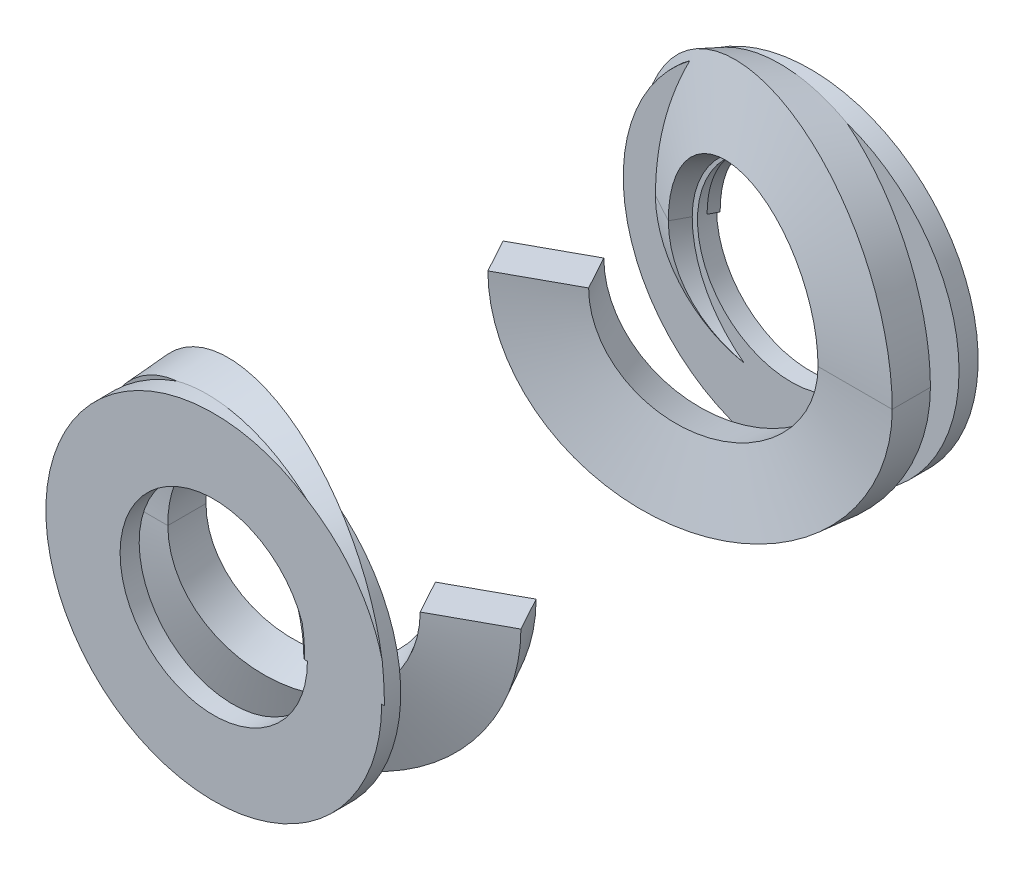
ISO-10303-21;
HEADER;
FILE_DESCRIPTION(('STEP AP214'),'2;1');
FILE_NAME('part.step','',(''),(''),'','','');
FILE_SCHEMA(('AUTOMOTIVE_DESIGN { 1 0 10303 214 1 1 1 1 }'));
ENDSEC;
DATA;
#1=APPLICATION_CONTEXT('core data for automotive mechanical design processes');
#2=APPLICATION_PROTOCOL_DEFINITION('international standard','automotive_design',2000,#1);
#3=PRODUCT_CONTEXT('',#1,'mechanical');
#4=PRODUCT('Part','Part','',(#3));
#5=PRODUCT_RELATED_PRODUCT_CATEGORY('part','',(#4));
#6=PRODUCT_DEFINITION_FORMATION('','',#4);
#7=PRODUCT_DEFINITION_CONTEXT('part definition',#1,'design');
#8=PRODUCT_DEFINITION('design','',#6,#7);
#9=PRODUCT_DEFINITION_SHAPE('','',#8);
#10=(LENGTH_UNIT() NAMED_UNIT(*) SI_UNIT(.MILLI.,.METRE.));
#11=(NAMED_UNIT(*) PLANE_ANGLE_UNIT() SI_UNIT($,.RADIAN.));
#12=(NAMED_UNIT(*) SI_UNIT($,.STERADIAN.) SOLID_ANGLE_UNIT());
#13=UNCERTAINTY_MEASURE_WITH_UNIT(LENGTH_MEASURE(1.E-05),#10,'distance_accuracy_value','');
#14=(GEOMETRIC_REPRESENTATION_CONTEXT(3) GLOBAL_UNCERTAINTY_ASSIGNED_CONTEXT((#13)) GLOBAL_UNIT_ASSIGNED_CONTEXT((#10,
#11,#12)) REPRESENTATION_CONTEXT('',''));
#15=CARTESIAN_POINT('',(0.,0.,0.));
#16=DIRECTION('',(0.,0.,1.));
#17=DIRECTION('',(1.,0.,0.));
#18=AXIS2_PLACEMENT_3D('',#15,#16,#17);
#19=CARTESIAN_POINT('',(-0.165541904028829,0.,-39.8135465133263));
#20=DIRECTION('',(-0.247461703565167,0.,0.968897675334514));
#21=DIRECTION('',(0.968897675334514,0.,0.247461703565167));
#22=AXIS2_PLACEMENT_3D('',#19,#20,#21);
#23=CONICAL_SURFACE('',#22,12.6231512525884,0.25005959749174);
#24=CARTESIAN_POINT('',(0.,0.,-42.0024331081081));
#25=DIRECTION('',(-0.126673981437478,0.,0.991944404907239));
#26=DIRECTION('',(-0.991944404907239,0.,-0.126673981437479));
#27=AXIS2_PLACEMENT_3D('',#24,#25,#26);
#28=ELLIPSE('',#27,12.1629800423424,12.065);
#29=CARTESIAN_POINT('',(-6.73100000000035,10.0128848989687,-42.862));
#30=VERTEX_POINT('',#29);
#31=CARTESIAN_POINT('',(4.00957142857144,11.3792601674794,-41.4904));
#32=VERTEX_POINT('',#31);
#33=EDGE_CURVE('E202',#30,#32,#28,.F.);
#34=ORIENTED_EDGE('',*,*,#33,.F.);
#35=CARTESIAN_POINT('',(-0.186114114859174,0.,-42.862));
#36=DIRECTION('',(0.,0.,1.));
#37=DIRECTION('',(-1.,0.,0.));
#38=AXIS2_PLACEMENT_3D('',#35,#36,#37);
#39=ELLIPSE('',#38,12.2511141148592,11.8447942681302);
#40=CARTESIAN_POINT('',(-12.1012857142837,2.75479556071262,-42.862));
#41=VERTEX_POINT('',#40);
#42=EDGE_CURVE('E73',#30,#41,#39,.T.);
#43=ORIENTED_EDGE('',*,*,#42,.T.);
#44=CARTESIAN_POINT('',(-0.165541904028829,0.,-39.8135465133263));
#45=DIRECTION('',(0.247461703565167,0.,-0.968897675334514));
#46=DIRECTION('',(-0.968897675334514,0.,-0.247461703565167));
#47=AXIS2_PLACEMENT_3D('',#44,#45,#46);
#48=CIRCLE('',#47,12.6231512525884);
#49=CARTESIAN_POINT('',(12.065,0.,-36.6898));
#50=VERTEX_POINT('',#49);
#51=EDGE_CURVE('E183',#41,#50,#48,.T.);
#52=ORIENTED_EDGE('',*,*,#51,.T.);
#53=DIRECTION('',(0.,0.,-1.));
#54=VECTOR('',#53,1.);
#55=CARTESIAN_POINT('',(12.065,0.,-39.433));
#56=LINE('',#55,#54);
#57=CARTESIAN_POINT('',(12.065,0.,-39.433));
#58=VERTEX_POINT('',#57);
#59=EDGE_CURVE('E236',#50,#58,#56,.T.);
#60=ORIENTED_EDGE('',*,*,#59,.T.);
#61=CARTESIAN_POINT('',(0.492181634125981,0.,-42.3887603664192));
#62=DIRECTION('',(0.247461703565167,0.,-0.968897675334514));
#63=DIRECTION('',(-0.968897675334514,0.,-0.247461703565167));
#64=AXIS2_PLACEMENT_3D('',#61,#62,#63);
#65=CIRCLE('',#64,11.9443143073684);
#66=EDGE_CURVE('E176',#32,#58,#65,.T.);
#67=ORIENTED_EDGE('',*,*,#66,.F.);
#68=EDGE_LOOP('',(#34,#43,#52,#60,#67));
#69=FACE_BOUND('',#68,.T.);
#70=ADVANCED_FACE('F51',(#69),#23,.T.);
#71=CARTESIAN_POINT('',(-0.492181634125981,0.,-38.5346396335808));
#72=DIRECTION('',(0.247461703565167,0.,-0.968897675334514));
#73=DIRECTION('',(-0.968897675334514,0.,-0.247461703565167));
#74=AXIS2_PLACEMENT_3D('',#71,#72,#73);
#75=CONICAL_SURFACE('',#74,7.45505105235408,1.32073672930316);
#76=ORIENTED_EDGE('',*,*,#51,.F.);
#77=CARTESIAN_POINT('',(-7.36676792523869,15.3759655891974,-42.862));
#78=CARTESIAN_POINT('',(-7.87008829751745,14.5849219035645,-42.862));
#79=CARTESIAN_POINT('',(-8.34620092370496,13.7755510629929,-42.862));
#80=CARTESIAN_POINT('',(-9.23366062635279,12.1192514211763,-42.862));
#81=CARTESIAN_POINT('',(-9.64482149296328,11.272223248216,-42.862));
#82=CARTESIAN_POINT('',(-10.3760127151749,9.57447343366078,-42.862));
#83=CARTESIAN_POINT('',(-10.6987329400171,8.72492269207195,-42.862));
#84=CARTESIAN_POINT('',(-11.2600755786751,6.99923897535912,-42.862));
#85=CARTESIAN_POINT('',(-11.4988002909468,6.12313975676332,-42.862));
#86=CARTESIAN_POINT('',(-11.8308729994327,4.5909411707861,-42.862));
#87=CARTESIAN_POINT('',(-11.9460835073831,3.93952534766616,-42.862));
#88=CARTESIAN_POINT('',(-12.1241252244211,2.62937511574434,-42.862));
#89=CARTESIAN_POINT('',(-12.1869544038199,1.97064042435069,-42.862));
#90=CARTESIAN_POINT('',(-12.2411318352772,0.971969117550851,-42.862));
#91=CARTESIAN_POINT('',(-12.2523898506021,0.632999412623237,-42.862));
#92=CARTESIAN_POINT('',(-12.2606348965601,-0.0451389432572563,-42.862));
#93=CARTESIAN_POINT('',(-12.25762179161,-0.384307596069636,-42.862));
#94=CARTESIAN_POINT('',(-12.237328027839,-1.06234212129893,-42.862));
#95=CARTESIAN_POINT('',(-12.220041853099,-1.40120782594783,-42.862));
#96=CARTESIAN_POINT('',(-12.171338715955,-2.07792019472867,-42.862));
#97=CARTESIAN_POINT('',(-12.1399218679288,-2.41576686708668,-42.862));
#98=CARTESIAN_POINT('',(-12.101511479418,-2.7528143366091,-42.862));
#99=B_SPLINE_CURVE_WITH_KNOTS('',3,(#77,#78,#79,#80,#81,#82,#83,#84,#85,#86,#87,#88,#89,#90,#91,
#92,#93,#94,#95,#96,#97,#98),.UNSPECIFIED.,.F.,.F.,(4,2,2,2,2,2,2,2,2,2,4),(0.,2.81351834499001,
5.6349618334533,8.35747491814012,11.0766606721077,13.0593538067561,15.0421237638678,
16.0593454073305,17.076576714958,18.094201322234,19.1118176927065),.UNSPECIFIED.);
#100=CARTESIAN_POINT('',(-12.2582998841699,0.,-42.862));
#101=VERTEX_POINT('',#100);
#102=EDGE_CURVE('E448',#41,#101,#99,.T.);
#103=ORIENTED_EDGE('',*,*,#102,.T.);
#104=DIRECTION('',(-0.877525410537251,0.,-0.479530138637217));
#105=VECTOR('',#104,1.);
#106=CARTESIAN_POINT('',(-12.3960838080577,0.,-42.9372930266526));
#107=LINE('',#106,#105);
#108=CARTESIAN_POINT('',(-12.065,0.,-42.756369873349));
#109=VERTEX_POINT('',#108);
#110=EDGE_CURVE('E166',#109,#101,#107,.T.);
#111=ORIENTED_EDGE('',*,*,#110,.F.);
#112=CARTESIAN_POINT('',(-1.02388552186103,12.021475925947,-39.8820535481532));
#113=CARTESIAN_POINT('',(-1.37100023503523,11.9919421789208,-39.9695765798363));
#114=CARTESIAN_POINT('',(-1.71684282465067,11.9473137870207,-40.057036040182));
#115=CARTESIAN_POINT('',(-2.40367572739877,11.8282666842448,-40.2312259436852));
#116=CARTESIAN_POINT('',(-2.74466437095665,11.7538379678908,-40.3179561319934));
#117=CARTESIAN_POINT('',(-3.41797274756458,11.5759456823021,-40.4897014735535));
#118=CARTESIAN_POINT('',(-3.75032032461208,11.4725926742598,-40.574721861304));
#119=CARTESIAN_POINT('',(-4.40515945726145,11.2374282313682,-40.7427088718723));
#120=CARTESIAN_POINT('',(-4.72765454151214,11.1056271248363,-40.8256762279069));
#121=CARTESIAN_POINT('',(-5.44001696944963,10.7777675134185,-41.0094412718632));
#122=CARTESIAN_POINT('',(-5.82650382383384,10.5738834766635,-41.109494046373));
#123=CARTESIAN_POINT('',(-6.57629097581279,10.1246087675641,-41.3042205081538));
#124=CARTESIAN_POINT('',(-6.93957991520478,9.87919797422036,-41.3988915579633));
#125=CARTESIAN_POINT('',(-7.55877399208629,9.40977675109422,-41.5607316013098));
#126=CARTESIAN_POINT('',(-7.82030382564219,9.19360340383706,-41.6292567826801));
#127=CARTESIAN_POINT('',(-8.32492894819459,8.73928143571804,-41.7617633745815));
#128=CARTESIAN_POINT('',(-8.56801979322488,8.501127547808,-41.8257436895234));
#129=CARTESIAN_POINT('',(-9.03404263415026,8.00415337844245,-41.948642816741));
#130=CARTESIAN_POINT('',(-9.25695302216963,7.74531149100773,-42.0075562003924));
#131=CARTESIAN_POINT('',(-9.6805335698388,7.20890201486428,-42.1197062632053));
#132=CARTESIAN_POINT('',(-9.88120546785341,6.93133589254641,-42.1729433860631));
#133=CARTESIAN_POINT('',(-10.2580853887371,6.36023530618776,-42.273085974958));
#134=CARTESIAN_POINT('',(-10.4343669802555,6.0667527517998,-42.320010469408));
#135=CARTESIAN_POINT('',(-10.7617122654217,5.46507817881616,-42.4072647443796));
#136=CARTESIAN_POINT('',(-10.9127741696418,5.15688511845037,-42.4475940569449));
#137=CARTESIAN_POINT('',(-11.1882029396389,4.5283464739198,-42.5212079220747));
#138=CARTESIAN_POINT('',(-11.3125970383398,4.20801368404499,-42.554499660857));
#139=CARTESIAN_POINT('',(-11.5337388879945,3.55741191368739,-42.613735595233));
#140=CARTESIAN_POINT('',(-11.6304934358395,3.22714539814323,-42.6396815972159));
#141=CARTESIAN_POINT('',(-11.8296245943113,2.42084891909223,-42.6931133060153));
#142=CARTESIAN_POINT('',(-11.9178057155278,1.94097595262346,-42.71680555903));
#143=CARTESIAN_POINT('',(-12.0354780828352,0.974001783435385,-42.7484296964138));
#144=CARTESIAN_POINT('',(-12.0650114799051,0.486906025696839,-42.7563728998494));
#145=CARTESIAN_POINT('',(-12.0649897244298,-0.436071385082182,-42.7563671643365));
#146=CARTESIAN_POINT('',(-12.0413228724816,-0.871950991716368,-42.7500019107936));
#147=CARTESIAN_POINT('',(-11.970657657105,-1.52155959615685,-42.7310090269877));
#148=CARTESIAN_POINT('',(-11.9412249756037,-1.73747029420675,-42.7230993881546));
#149=CARTESIAN_POINT('',(-11.8707458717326,-2.16726329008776,-42.7041663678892));
#150=CARTESIAN_POINT('',(-11.8296987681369,-2.38114546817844,-42.6931428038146));
#151=CARTESIAN_POINT('',(-11.7829057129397,-2.59371508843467,-42.6805815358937));
#152=B_SPLINE_CURVE_WITH_KNOTS('',3,(#112,#113,#114,#115,#116,#117,#118,#119,#120,#121,#122,
#123,#124,#125,#126,#127,#128,#129,#130,#131,#132,#133,#134,#135,#136,#137,#138,#139,#140,#141,
#142,#143,#144,#145,#146,#147,#148,#149,#150,#151),.UNSPECIFIED.,.F.,.F.,(4,2,2,2,2,2,2,2,2,2,2,
2,2,2,2,2,2,2,2,4),(0.,1.07726370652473,2.15488940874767,3.22845093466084,4.30162334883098,
5.64385988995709,6.98674865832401,8.02406890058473,9.06163835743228,10.1003059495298,
11.1388922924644,12.1742742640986,13.2097296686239,14.2441225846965,15.278260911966,
16.7396942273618,18.2000768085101,19.5068538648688,20.1607092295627,20.8146029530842),.UNSPECIFIED.);
#153=CARTESIAN_POINT('',(-7.28968785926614,9.61377532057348,-41.4904));
#154=VERTEX_POINT('',#153);
#155=EDGE_CURVE('E465',#154,#109,#152,.T.);
#156=ORIENTED_EDGE('',*,*,#155,.F.);
#157=CARTESIAN_POINT('',(-9.55467470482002,-2.69801601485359,-41.4904));
#158=CARTESIAN_POINT('',(-9.59279179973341,-2.43251729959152,-41.4904));
#159=CARTESIAN_POINT('',(-9.62537766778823,-2.16625219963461,-41.4904));
#160=CARTESIAN_POINT('',(-9.67930637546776,-1.63257953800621,-41.4904));
#161=CARTESIAN_POINT('',(-9.70064890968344,-1.36517194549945,-41.4904));
#162=CARTESIAN_POINT('',(-9.74751936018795,-0.562161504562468,-41.4904));
#163=CARTESIAN_POINT('',(-9.75593593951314,-0.0254538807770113,-41.4904));
#164=CARTESIAN_POINT('',(-9.72698580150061,1.04060507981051,-41.4904));
#165=CARTESIAN_POINT('',(-9.6901325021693,1.56997130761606,-41.4904));
#166=CARTESIAN_POINT('',(-9.57256716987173,2.62379496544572,-41.4904));
#167=CARTESIAN_POINT('',(-9.49185516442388,3.14825239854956,-41.4904));
#168=CARTESIAN_POINT('',(-9.28825044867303,4.19143656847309,-41.4904));
#169=CARTESIAN_POINT('',(-9.16515966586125,4.71012437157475,-41.4904));
#170=CARTESIAN_POINT('',(-8.87990525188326,5.73661324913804,-41.4904));
#171=CARTESIAN_POINT('',(-8.71773885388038,6.2444135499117,-41.4904));
#172=CARTESIAN_POINT('',(-8.35700027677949,7.24955944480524,-41.4904));
#173=CARTESIAN_POINT('',(-8.15825912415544,7.74684405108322,-41.4904));
#174=CARTESIAN_POINT('',(-7.72862573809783,8.72722454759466,-41.4904));
#175=CARTESIAN_POINT('',(-7.49773511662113,9.21032114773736,-41.4904));
#176=CARTESIAN_POINT('',(-7.02007018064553,10.1372474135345,-41.4904));
#177=CARTESIAN_POINT('',(-6.77472597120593,10.5818181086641,-41.4904));
#178=CARTESIAN_POINT('',(-6.26125369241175,11.4576327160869,-41.4904));
#179=CARTESIAN_POINT('',(-5.99312287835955,11.8888750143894,-41.4904));
#180=CARTESIAN_POINT('',(-5.43907312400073,12.7346152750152,-41.4904));
#181=CARTESIAN_POINT('',(-5.15332014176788,13.1492224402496,-41.4904));
#182=CARTESIAN_POINT('',(-4.56445757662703,13.9655906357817,-41.4904));
#183=CARTESIAN_POINT('',(-4.26135771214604,14.3673586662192,-41.4904));
#184=CARTESIAN_POINT('',(-3.9506272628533,14.7630160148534,-41.4904));
#185=B_SPLINE_CURVE_WITH_KNOTS('',3,(#157,#158,#159,#160,#161,#162,#163,#164,#165,#166,#167,
#168,#169,#170,#171,#172,#173,#174,#175,#176,#177,#178,#179,#180,#181,#182,#183,#184),
.UNSPECIFIED.,.F.,.F.,(4,2,2,2,2,2,2,2,2,2,2,2,2,4),(0.,0.804546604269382,1.60911506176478,
3.21729389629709,4.80740113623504,6.39750737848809,7.99514878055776,9.59290334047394,
11.1982337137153,12.8034836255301,14.3260746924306,15.8488494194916,17.3589957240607,
18.8683041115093),.UNSPECIFIED.);
#186=CARTESIAN_POINT('',(-9.74831405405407,0.,-41.4904));
#187=VERTEX_POINT('',#186);
#188=EDGE_CURVE('E260',#187,#154,#185,.T.);
#189=ORIENTED_EDGE('',*,*,#188,.F.);
#190=CARTESIAN_POINT('',(-7.71536326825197,0.,-40.3794792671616));
#191=VERTEX_POINT('',#190);
#192=EDGE_CURVE('E173',#191,#187,#107,.T.);
#193=ORIENTED_EDGE('',*,*,#192,.F.);
#194=CARTESIAN_POINT('',(-0.492181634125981,0.,-38.5346396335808));
#195=DIRECTION('',(0.247461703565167,0.,-0.968897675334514));
#196=DIRECTION('',(-0.968897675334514,0.,-0.247461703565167));
#197=AXIS2_PLACEMENT_3D('',#194,#195,#196);
#198=CIRCLE('',#197,7.45505105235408);
#199=CARTESIAN_POINT('',(6.73100000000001,0.,-36.6898));
#200=VERTEX_POINT('',#199);
#201=EDGE_CURVE('E180',#191,#200,#198,.T.);
#202=ORIENTED_EDGE('',*,*,#201,.T.);
#203=DIRECTION('',(1.,0.,0.));
#204=VECTOR('',#203,1.);
#205=CARTESIAN_POINT('',(12.065,0.,-36.6898));
#206=LINE('',#205,#204);
#207=EDGE_CURVE('E164',#200,#50,#206,.T.);
#208=ORIENTED_EDGE('',*,*,#207,.T.);
#209=EDGE_LOOP('',(#76,#103,#111,#156,#189,#193,#202,#208));
#210=FACE_BOUND('',#209,.T.);
#211=ADVANCED_FACE('F53',(#210),#75,.T.);
#212=CARTESIAN_POINT('',(0.165541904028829,0.,-41.1098534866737));
#213=DIRECTION('',(-0.247461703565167,0.,0.968897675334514));
#214=DIRECTION('',(0.968897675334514,0.,0.247461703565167));
#215=AXIS2_PLACEMENT_3D('',#212,#213,#214);
#216=CONICAL_SURFACE('',#215,6.77621410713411,0.25005959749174);
#217=CARTESIAN_POINT('',(-0.188646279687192,0.,-41.4904));
#218=DIRECTION('',(0.,0.,-1.));
#219=DIRECTION('',(-1.,0.,0.));
#220=AXIS2_PLACEMENT_3D('',#217,#218,#219);
#221=ELLIPSE('',#220,6.9196462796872,6.69014963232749);
#222=CARTESIAN_POINT('',(-1.32442857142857,6.59941284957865,-41.4904));
#223=VERTEX_POINT('',#222);
#224=CARTESIAN_POINT('',(-7.1082925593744,0.,-41.4904));
#225=VERTEX_POINT('',#224);
#226=EDGE_CURVE('E271',#223,#225,#221,.F.);
#227=ORIENTED_EDGE('',*,*,#226,.F.);
#228=CARTESIAN_POINT('',(0.165541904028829,0.,-41.1098534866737));
#229=DIRECTION('',(0.247461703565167,0.,-0.968897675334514));
#230=DIRECTION('',(-0.968897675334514,0.,-0.247461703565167));
#231=AXIS2_PLACEMENT_3D('',#228,#229,#230);
#232=CIRCLE('',#231,6.77621410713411);
#233=CARTESIAN_POINT('',(6.73100000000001,0.,-39.433));
#234=VERTEX_POINT('',#233);
#235=EDGE_CURVE('E178',#223,#234,#232,.T.);
#236=ORIENTED_EDGE('',*,*,#235,.T.);
#237=DIRECTION('',(0.,0.,1.));
#238=VECTOR('',#237,1.);
#239=CARTESIAN_POINT('',(6.73100000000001,0.,-39.433));
#240=LINE('',#239,#238);
#241=EDGE_CURVE('E169',#234,#200,#240,.T.);
#242=ORIENTED_EDGE('',*,*,#241,.T.);
#243=ORIENTED_EDGE('',*,*,#201,.F.);
#244=DIRECTION('',(0.479530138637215,0.,-0.877525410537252));
#245=VECTOR('',#244,1.);
#246=CARTESIAN_POINT('',(-7.1082925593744,0.,-41.4904));
#247=LINE('',#246,#245);
#248=EDGE_CURVE('E196',#191,#225,#247,.T.);
#249=ORIENTED_EDGE('',*,*,#248,.T.);
#250=EDGE_LOOP('',(#227,#236,#242,#243,#249));
#251=FACE_BOUND('',#250,.T.);
#252=ADVANCED_FACE('F245',(#251),#216,.F.);
#253=CARTESIAN_POINT('',(0.492181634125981,0.,-42.3887603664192));
#254=DIRECTION('',(0.247461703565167,0.,-0.968897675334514));
#255=DIRECTION('',(-0.968897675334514,0.,-0.247461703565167));
#256=AXIS2_PLACEMENT_3D('',#253,#254,#255);
#257=CONICAL_SURFACE('',#256,11.9443143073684,1.32073672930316);
#258=CARTESIAN_POINT('',(9.11102413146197,14.5491009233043,-41.4904));
#259=CARTESIAN_POINT('',(8.77600322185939,14.3635974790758,-41.4904));
#260=CARTESIAN_POINT('',(8.44247823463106,14.1754003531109,-41.4904));
#261=CARTESIAN_POINT('',(7.77878550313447,13.7930934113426,-41.4904));
#262=CARTESIAN_POINT('',(7.44861814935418,13.5989829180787,-41.4904));
#263=CARTESIAN_POINT('',(6.46236116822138,13.0061836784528,-41.4904));
#264=CARTESIAN_POINT('',(5.81200507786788,12.5978448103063,-41.4904));
#265=CARTESIAN_POINT('',(4.52111488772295,11.7436959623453,-41.4904));
#266=CARTESIAN_POINT('',(3.88090938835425,11.2973870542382,-41.4904));
#267=CARTESIAN_POINT('',(2.62932457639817,10.3666526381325,-41.4904));
#268=CARTESIAN_POINT('',(2.01791768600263,9.88226483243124,-41.4904));
#269=CARTESIAN_POINT('',(1.11970635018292,9.11035675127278,-41.4904));
#270=CARTESIAN_POINT('',(0.81808083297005,8.84006558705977,-41.4904));
#271=CARTESIAN_POINT('',(0.228187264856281,8.28512841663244,-41.4904));
#272=CARTESIAN_POINT('',(-0.0600789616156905,8.00048046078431,-41.4904));
#273=CARTESIAN_POINT('',(-0.619466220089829,7.41586177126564,-41.4904));
#274=CARTESIAN_POINT('',(-0.890623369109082,7.11592590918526,-41.4904));
#275=CARTESIAN_POINT('',(-1.4122017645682,6.49872591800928,-41.4904));
#276=CARTESIAN_POINT('',(-1.66262882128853,6.18146668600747,-41.4904));
#277=CARTESIAN_POINT('',(-2.25687537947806,5.36380554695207,-41.4904));
#278=CARTESIAN_POINT('',(-2.58467198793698,4.85124311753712,-41.4904));
#279=CARTESIAN_POINT('',(-3.014083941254,4.04988361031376,-41.4904));
#280=CARTESIAN_POINT('',(-3.14675724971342,3.77758154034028,-41.4904));
#281=CARTESIAN_POINT('',(-3.38795609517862,3.22242214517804,-41.4904));
#282=CARTESIAN_POINT('',(-3.49648948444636,2.93956828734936,-41.4904));
#283=CARTESIAN_POINT('',(-3.66482989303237,2.42827612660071,-41.4904));
#284=CARTESIAN_POINT('',(-3.73010461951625,2.20163240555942,-41.4904));
#285=CARTESIAN_POINT('',(-3.84220908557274,1.74384465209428,-41.4904));
#286=CARTESIAN_POINT('',(-3.88904352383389,1.51270178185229,-41.4904));
#287=CARTESIAN_POINT('',(-3.96300749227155,1.04721491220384,-41.4904));
#288=CARTESIAN_POINT('',(-3.99013270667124,0.812870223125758,-41.4904));
#289=CARTESIAN_POINT('',(-4.02385214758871,0.342719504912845,-41.4904));
#290=CARTESIAN_POINT('',(-4.03044906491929,0.106913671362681,-41.4904));
#291=CARTESIAN_POINT('',(-4.02333535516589,-0.338512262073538,-41.4904));
#292=CARTESIAN_POINT('',(-4.01177109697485,-0.548169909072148,-41.4904));
#293=CARTESIAN_POINT('',(-3.97250414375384,-0.965990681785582,-41.4904));
#294=CARTESIAN_POINT('',(-3.94479968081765,-1.17415364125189,-41.4904));
#295=CARTESIAN_POINT('',(-3.87379788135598,-1.58829114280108,-41.4904));
#296=CARTESIAN_POINT('',(-3.83046336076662,-1.79425924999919,-41.4904));
#297=CARTESIAN_POINT('',(-3.72920981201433,-2.20250052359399,-41.4904));
#298=CARTESIAN_POINT('',(-3.67129661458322,-2.40477513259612,-41.4904));
#299=CARTESIAN_POINT('',(-3.60657509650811,-2.604786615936,-41.4904));
#300=B_SPLINE_CURVE_WITH_KNOTS('',3,(#258,#259,#260,#261,#262,#263,#264,#265,#266,#267,#268,
#269,#270,#271,#272,#273,#274,#275,#276,#277,#278,#279,#280,#281,#282,#283,#284,#285,#286,#287,
#288,#289,#290,#291,#292,#293,#294,#295,#296,#297,#298,#299),.UNSPECIFIED.,.F.,.F.,(4,2,2,2,2,2,
2,2,2,2,2,2,2,2,2,2,2,2,2,2,4),(0.,1.14882295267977,2.29777801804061,4.60077982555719,
6.94100108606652,9.27893376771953,10.4935909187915,11.7084134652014,12.9205792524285,
14.1324041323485,15.9510074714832,16.8588184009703,17.7663336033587,18.4732165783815,
19.1799193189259,19.8867767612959,20.5935415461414,21.222848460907,21.8522243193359,
22.4831074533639,23.1137386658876),.UNSPECIFIED.);
#301=EDGE_CURVE('E273',#32,#223,#300,.T.);
#302=ORIENTED_EDGE('',*,*,#301,.F.);
#303=ORIENTED_EDGE('',*,*,#66,.T.);
#304=DIRECTION('',(-1.,0.,0.));
#305=VECTOR('',#304,1.);
#306=CARTESIAN_POINT('',(12.065,0.,-39.433));
#307=LINE('',#306,#305);
#308=EDGE_CURVE('E239',#58,#234,#307,.T.);
#309=ORIENTED_EDGE('',*,*,#308,.T.);
#310=ORIENTED_EDGE('',*,*,#235,.F.);
#311=EDGE_LOOP('',(#302,#303,#309,#310));
#312=FACE_BOUND('',#311,.T.);
#313=ADVANCED_FACE('F277',(#312),#257,.F.);
#314=CARTESIAN_POINT('',(-12.3960838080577,0.,-42.9372930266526));
#315=DIRECTION('',(0.,1.,0.));
#316=DIRECTION('',(0.479530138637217,0.,-0.877525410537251));
#317=AXIS2_PLACEMENT_3D('',#314,#315,#316);
#318=PLANE('',#317);
#319=ORIENTED_EDGE('',*,*,#110,.T.);
#320=DIRECTION('',(1.,0.,0.));
#321=VECTOR('',#320,1.);
#322=CARTESIAN_POINT('',(-12.3960838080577,0.,-42.862));
#323=LINE('',#322,#321);
#324=CARTESIAN_POINT('',(-12.065,0.,-42.862));
#325=VERTEX_POINT('',#324);
#326=EDGE_CURVE('E456',#101,#325,#323,.T.);
#327=ORIENTED_EDGE('',*,*,#326,.T.);
#328=DIRECTION('',(0.,0.,1.));
#329=VECTOR('',#328,1.);
#330=CARTESIAN_POINT('',(-12.065,0.,0.));
#331=LINE('',#330,#329);
#332=EDGE_CURVE('E185',#109,#325,#331,.F.);
#333=ORIENTED_EDGE('',*,*,#332,.F.);
#334=EDGE_LOOP('',(#319,#327,#333));
#335=FACE_BOUND('',#334,.T.);
#336=ADVANCED_FACE('F336',(#335),#318,.F.);
#337=CARTESIAN_POINT('',(-0.268098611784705,0.,-43.9116982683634));
#338=DIRECTION('',(-0.247461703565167,0.,-0.968897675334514));
#339=DIRECTION('',(-0.968897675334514,0.,0.247461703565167));
#340=AXIS2_PLACEMENT_3D('',#337,#338,#339);
#341=CONICAL_SURFACE('',#340,9.78453729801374,0.820617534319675);
#342=ORIENTED_EDGE('',*,*,#192,.T.);
#343=CARTESIAN_POINT('',(-1.82198128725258,0.,-41.4904));
#344=DIRECTION('',(0.,0.,-1.));
#345=DIRECTION('',(-1.,0.,0.));
#346=AXIS2_PLACEMENT_3D('',#343,#344,#345);
#347=ELLIPSE('',#346,7.92633276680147,7.3857643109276);
#348=CARTESIAN_POINT('',(-3.36572653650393,-7.24433143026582,-41.4904));
#349=VERTEX_POINT('',#348);
#350=EDGE_CURVE('E264',#187,#349,#347,.F.);
#351=ORIENTED_EDGE('',*,*,#350,.T.);
#352=CARTESIAN_POINT('',(0.122753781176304,0.,-42.3813767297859));
#353=DIRECTION('',(-0.247461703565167,0.,-0.968897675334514));
#354=DIRECTION('',(-0.968897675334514,0.,0.247461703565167));
#355=AXIS2_PLACEMENT_3D('',#352,#353,#354);
#356=CIRCLE('',#355,8.08972634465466);
#357=EDGE_CURVE('E200',#349,#191,#356,.T.);
#358=ORIENTED_EDGE('',*,*,#357,.T.);
#359=EDGE_LOOP('',(#342,#351,#358));
#360=FACE_BOUND('',#359,.T.);
#361=ADVANCED_FACE('F263',(#360),#341,.T.);
#362=CARTESIAN_POINT('',(0.122753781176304,0.,-42.3813767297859));
#363=DIRECTION('',(0.247461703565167,0.,0.968897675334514));
#364=DIRECTION('',(0.968897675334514,0.,-0.247461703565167));
#365=AXIS2_PLACEMENT_3D('',#362,#363,#364);
#366=CONICAL_SURFACE('',#365,8.08972634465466,0.750178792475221);
#367=ORIENTED_EDGE('',*,*,#357,.F.);
#368=CARTESIAN_POINT('',(2.68016305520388,0.,-41.4904));
#369=DIRECTION('',(0.,0.,-1.));
#370=DIRECTION('',(1.,0.,0.));
#371=AXIS2_PLACEMENT_3D('',#368,#369,#370);
#372=ELLIPSE('',#371,9.78845561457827,9.21144360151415);
#373=EDGE_CURVE('E270',#349,#225,#372,.T.);
#374=ORIENTED_EDGE('',*,*,#373,.T.);
#375=ORIENTED_EDGE('',*,*,#248,.F.);
#376=EDGE_LOOP('',(#367,#374,#375));
#377=FACE_BOUND('',#376,.T.);
#378=ADVANCED_FACE('F269',(#377),#366,.F.);
#379=CARTESIAN_POINT('',(-0.165541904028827,0.,-36.3092534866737));
#380=DIRECTION('',(0.247461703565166,0.,0.968897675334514));
#381=DIRECTION('',(0.968897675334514,0.,-0.247461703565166));
#382=AXIS2_PLACEMENT_3D('',#379,#380,#381);
#383=CONICAL_SURFACE('',#382,12.6231512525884,1.32073672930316);
#384=CARTESIAN_POINT('',(-0.492181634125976,0.,-37.5881603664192));
#385=DIRECTION('',(0.247461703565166,0.,0.968897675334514));
#386=DIRECTION('',(0.968897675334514,0.,-0.247461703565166));
#387=AXIS2_PLACEMENT_3D('',#384,#385,#386);
#388=CIRCLE('',#387,7.45505105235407);
#389=CARTESIAN_POINT('',(-7.71536326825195,0.,-35.7433207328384));
#390=VERTEX_POINT('',#389);
#391=EDGE_CURVE('E233',#390,#234,#388,.T.);
#392=ORIENTED_EDGE('',*,*,#391,.T.);
#393=ORIENTED_EDGE('',*,*,#308,.F.);
#394=CARTESIAN_POINT('',(-0.165541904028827,0.,-36.3092534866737));
#395=DIRECTION('',(0.247461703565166,0.,0.968897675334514));
#396=DIRECTION('',(0.968897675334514,0.,-0.247461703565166));
#397=AXIS2_PLACEMENT_3D('',#394,#395,#396);
#398=CIRCLE('',#397,12.6231512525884);
#399=CARTESIAN_POINT('',(-12.3960838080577,0.,-33.1855069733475));
#400=VERTEX_POINT('',#399);
#401=EDGE_CURVE('E224',#400,#58,#398,.T.);
#402=ORIENTED_EDGE('',*,*,#401,.F.);
#403=DIRECTION('',(0.877525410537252,0.,-0.479530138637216));
#404=VECTOR('',#403,1.);
#405=CARTESIAN_POINT('',(-12.3960838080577,0.,-33.1855069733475));
#406=LINE('',#405,#404);
#407=EDGE_CURVE('E212',#400,#390,#406,.T.);
#408=ORIENTED_EDGE('',*,*,#407,.T.);
#409=EDGE_LOOP('',(#392,#393,#402,#408));
#410=FACE_BOUND('',#409,.T.);
#411=ADVANCED_FACE('F282',(#410),#383,.T.);
#412=CARTESIAN_POINT('',(-0.492181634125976,0.,-37.5881603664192));
#413=DIRECTION('',(-0.247461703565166,0.,-0.968897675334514));
#414=DIRECTION('',(-0.968897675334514,0.,0.247461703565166));
#415=AXIS2_PLACEMENT_3D('',#412,#413,#414);
#416=CONICAL_SURFACE('',#415,7.45505105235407,0.250059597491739);
#417=CARTESIAN_POINT('',(0.165541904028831,0.,-35.0129465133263));
#418=DIRECTION('',(0.247461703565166,0.,0.968897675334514));
#419=DIRECTION('',(0.968897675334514,0.,-0.247461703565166));
#420=AXIS2_PLACEMENT_3D('',#417,#418,#419);
#421=CIRCLE('',#420,6.7762141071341);
#422=CARTESIAN_POINT('',(-6.39991619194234,0.,-33.3360930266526));
#423=VERTEX_POINT('',#422);
#424=EDGE_CURVE('E230',#423,#200,#421,.T.);
#425=ORIENTED_EDGE('',*,*,#424,.T.);
#426=ORIENTED_EDGE('',*,*,#241,.F.);
#427=ORIENTED_EDGE('',*,*,#391,.F.);
#428=DIRECTION('',(0.479530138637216,0.,0.877525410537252));
#429=VECTOR('',#428,1.);
#430=CARTESIAN_POINT('',(-7.71536326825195,0.,-35.7433207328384));
#431=LINE('',#430,#429);
#432=EDGE_CURVE('E215',#390,#423,#431,.T.);
#433=ORIENTED_EDGE('',*,*,#432,.T.);
#434=EDGE_LOOP('',(#425,#426,#427,#433));
#435=FACE_BOUND('',#434,.T.);
#436=ADVANCED_FACE('F250',(#435),#416,.F.);
#437=CARTESIAN_POINT('',(0.165541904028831,0.,-35.0129465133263));
#438=DIRECTION('',(0.247461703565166,0.,0.968897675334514));
#439=DIRECTION('',(0.968897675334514,0.,-0.247461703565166));
#440=AXIS2_PLACEMENT_3D('',#437,#438,#439);
#441=CONICAL_SURFACE('',#440,6.7762141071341,1.32073672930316);
#442=CARTESIAN_POINT('',(0.492181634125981,0.,-33.7340396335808));
#443=DIRECTION('',(0.247461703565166,0.,0.968897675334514));
#444=DIRECTION('',(0.968897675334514,0.,-0.247461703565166));
#445=AXIS2_PLACEMENT_3D('',#442,#443,#444);
#446=CIRCLE('',#445,11.9443143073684);
#447=CARTESIAN_POINT('',(-11.080636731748,0.,-30.7782792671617));
#448=VERTEX_POINT('',#447);
#449=EDGE_CURVE('E227',#448,#50,#446,.T.);
#450=ORIENTED_EDGE('',*,*,#449,.T.);
#451=ORIENTED_EDGE('',*,*,#207,.F.);
#452=ORIENTED_EDGE('',*,*,#424,.F.);
#453=DIRECTION('',(-0.877525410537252,0.,0.479530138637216));
#454=VECTOR('',#453,1.);
#455=CARTESIAN_POINT('',(-6.39991619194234,0.,-33.3360930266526));
#456=LINE('',#455,#454);
#457=EDGE_CURVE('E218',#423,#448,#456,.T.);
#458=ORIENTED_EDGE('',*,*,#457,.T.);
#459=EDGE_LOOP('',(#450,#451,#452,#458));
#460=FACE_BOUND('',#459,.T.);
#461=ADVANCED_FACE('F254',(#460),#441,.F.);
#462=CARTESIAN_POINT('',(0.492181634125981,0.,-33.7340396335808));
#463=DIRECTION('',(-0.247461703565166,0.,-0.968897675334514));
#464=DIRECTION('',(-0.968897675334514,0.,0.247461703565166));
#465=AXIS2_PLACEMENT_3D('',#462,#463,#464);
#466=CONICAL_SURFACE('',#465,11.9443143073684,0.250059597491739);
#467=DIRECTION('',(-0.479530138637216,0.,-0.877525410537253));
#468=VECTOR('',#467,1.);
#469=CARTESIAN_POINT('',(-11.080636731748,0.,-30.7782792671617));
#470=LINE('',#469,#468);
#471=EDGE_CURVE('E221',#448,#400,#470,.T.);
#472=ORIENTED_EDGE('',*,*,#471,.T.);
#473=ORIENTED_EDGE('',*,*,#401,.T.);
#474=ORIENTED_EDGE('',*,*,#59,.F.);
#475=ORIENTED_EDGE('',*,*,#449,.F.);
#476=EDGE_LOOP('',(#472,#473,#474,#475));
#477=FACE_BOUND('',#476,.T.);
#478=ADVANCED_FACE('F285',(#477),#466,.T.);
#479=CARTESIAN_POINT('',(-7.71536326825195,0.,-35.7433207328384));
#480=DIRECTION('',(0.,-1.,0.));
#481=DIRECTION('',(0.479530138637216,0.,0.877525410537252));
#482=AXIS2_PLACEMENT_3D('',#479,#480,#481);
#483=PLANE('',#482);
#484=ORIENTED_EDGE('',*,*,#407,.F.);
#485=ORIENTED_EDGE('',*,*,#471,.F.);
#486=ORIENTED_EDGE('',*,*,#457,.F.);
#487=ORIENTED_EDGE('',*,*,#432,.F.);
#488=EDGE_LOOP('',(#484,#485,#486,#487));
#489=FACE_BOUND('',#488,.T.);
#490=ADVANCED_FACE('F288',(#489),#483,.F.);
#491=CARTESIAN_POINT('',(0.,0.,0.));
#492=DIRECTION('',(0.,0.,1.));
#493=DIRECTION('',(1.,0.,0.));
#494=AXIS2_PLACEMENT_3D('',#491,#492,#493);
#495=CYLINDRICAL_SURFACE('',#494,6.731);
#496=CARTESIAN_POINT('',(-1.32367606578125,6.59956382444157,-41.4902));
#497=CARTESIAN_POINT('',(-1.51421445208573,6.5613650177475,-41.5408393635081));
#498=CARTESIAN_POINT('',(-1.70316341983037,6.51486726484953,-41.5912075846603));
#499=CARTESIAN_POINT('',(-2.07656676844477,6.40562358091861,-41.6910284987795));
#500=CARTESIAN_POINT('',(-2.26102084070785,6.34287653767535,-41.7404811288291));
#501=CARTESIAN_POINT('',(-2.62426772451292,6.20142095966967,-41.8381377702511));
#502=CARTESIAN_POINT('',(-2.80305488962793,6.12269705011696,-41.8863405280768));
#503=CARTESIAN_POINT('',(-3.15345939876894,5.94980813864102,-41.9810628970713));
#504=CARTESIAN_POINT('',(-3.32507703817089,5.85564377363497,-42.0275825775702));
#505=CARTESIAN_POINT('',(-3.65947153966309,5.6526804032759,-42.1184527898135));
#506=CARTESIAN_POINT('',(-3.82226770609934,5.54391532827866,-42.1628080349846));
#507=CARTESIAN_POINT('',(-4.13824011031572,5.3122239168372,-42.2490991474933));
#508=CARTESIAN_POINT('',(-4.29141264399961,5.18929217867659,-42.2910340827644));
#509=CARTESIAN_POINT('',(-4.58666055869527,4.93025624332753,-42.3720408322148));
#510=CARTESIAN_POINT('',(-4.72874919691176,4.7941682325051,-42.4111160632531));
#511=CARTESIAN_POINT('',(-5.00091849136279,4.50954127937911,-42.48611153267));
#512=CARTESIAN_POINT('',(-5.13099369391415,4.36099674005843,-42.5220303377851));
#513=CARTESIAN_POINT('',(-5.37446681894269,4.05688744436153,-42.5893809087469));
#514=CARTESIAN_POINT('',(-5.48823065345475,3.90163723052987,-42.6209103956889));
#515=CARTESIAN_POINT('',(-5.70226945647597,3.58155402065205,-42.6803199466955));
#516=CARTESIAN_POINT('',(-5.80255133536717,3.41672599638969,-42.7082018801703));
#517=CARTESIAN_POINT('',(-5.98886374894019,3.07850104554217,-42.7600695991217));
#518=CARTESIAN_POINT('',(-6.07488681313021,2.90509968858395,-42.7840533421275));
#519=CARTESIAN_POINT('',(-6.23180536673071,2.55116016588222,-42.8278490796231));
#520=CARTESIAN_POINT('',(-6.30270743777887,2.37062514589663,-42.8476628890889));
#521=CARTESIAN_POINT('',(-6.42585985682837,2.01219341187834,-42.8821061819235));
#522=CARTESIAN_POINT('',(-6.47881960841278,1.83455902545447,-42.896932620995));
#523=CARTESIAN_POINT('',(-6.56995784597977,1.47525229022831,-42.9224617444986));
#524=CARTESIAN_POINT('',(-6.6081370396,1.29358013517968,-42.9331646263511));
#525=CARTESIAN_POINT('',(-6.66941150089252,0.927264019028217,-42.9503474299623));
#526=CARTESIAN_POINT('',(-6.69248674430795,0.742616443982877,-42.9568217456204));
#527=CARTESIAN_POINT('',(-6.72329740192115,0.371914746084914,-42.9654682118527));
#528=CARTESIAN_POINT('',(-6.73103016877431,0.18586038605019,-42.96763961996));
#529=CARTESIAN_POINT('',(-6.73099999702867,-0.000200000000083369,-42.967630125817));
#530=B_SPLINE_CURVE_WITH_KNOTS('',3,(#496,#497,#498,#499,#500,#501,#502,#503,#504,#505,#506,
#507,#508,#509,#510,#511,#512,#513,#514,#515,#516,#517,#518,#519,#520,#521,#522,#523,#524,#525,
#526,#527,#528,#529),.UNSPECIFIED.,.F.,.F.,(4,2,2,2,2,2,2,2,2,2,2,2,2,2,2,2,4),(0.,
0.602285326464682,1.20461188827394,1.80752085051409,2.41040494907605,3.01191151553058,
3.61364819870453,4.21465375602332,4.81593082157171,5.40031269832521,5.98439388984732,
6.56878013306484,7.1529114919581,7.71010277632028,8.26726738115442,8.82516916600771,
9.3831672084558),.UNSPECIFIED.);
#531=CARTESIAN_POINT('',(-6.35396928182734,2.22113380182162,-42.862));
#532=VERTEX_POINT('',#531);
#533=EDGE_CURVE('E197',#223,#532,#530,.T.);
#534=ORIENTED_EDGE('',*,*,#533,.T.);
#535=CARTESIAN_POINT('',(0.,0.,-42.862));
#536=DIRECTION('',(0.,0.,1.));
#537=DIRECTION('',(1.,0.,0.));
#538=AXIS2_PLACEMENT_3D('',#535,#536,#537);
#539=CIRCLE('',#538,6.731);
#540=CARTESIAN_POINT('',(-6.731,0.,-42.862));
#541=VERTEX_POINT('',#540);
#542=EDGE_CURVE('E81',#532,#541,#539,.F.);
#543=ORIENTED_EDGE('',*,*,#542,.T.);
#544=DIRECTION('',(0.,0.,1.));
#545=VECTOR('',#544,1.);
#546=CARTESIAN_POINT('',(-6.731,0.,0.));
#547=LINE('',#546,#545);
#548=CARTESIAN_POINT('',(-6.731,0.,-42.1808337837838));
#549=VERTEX_POINT('',#548);
#550=EDGE_CURVE('E66',#541,#549,#547,.T.);
#551=ORIENTED_EDGE('',*,*,#550,.T.);
#552=CARTESIAN_POINT('',(0.,0.,-41.3212668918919));
#553=DIRECTION('',(-0.126673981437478,0.,0.991944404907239));
#554=DIRECTION('',(-0.991944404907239,0.,-0.126673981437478));
#555=AXIS2_PLACEMENT_3D('',#552,#553,#554);
#556=ELLIPSE('',#555,6.78566254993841,6.731);
#557=EDGE_CURVE('E192',#549,#223,#556,.F.);
#558=ORIENTED_EDGE('',*,*,#557,.T.);
#559=CARTESIAN_POINT('',(0.,0.,-41.4904));
#560=DIRECTION('',(0.,0.,1.));
#561=DIRECTION('',(1.,0.,0.));
#562=AXIS2_PLACEMENT_3D('',#559,#560,#561);
#563=CIRCLE('',#562,6.731);
#564=EDGE_CURVE('E462',#223,#223,#563,.T.);
#565=ORIENTED_EDGE('',*,*,#564,.T.);
#566=EDGE_LOOP('',(#534,#543,#551,#558,#565));
#567=FACE_BOUND('',#566,.T.);
#568=ADVANCED_FACE('F189',(#567),#495,.F.);
#569=CARTESIAN_POINT('',(0.,0.,0.));
#570=DIRECTION('',(0.,0.,1.));
#571=DIRECTION('',(1.,0.,0.));
#572=AXIS2_PLACEMENT_3D('',#569,#570,#571);
#573=CYLINDRICAL_SURFACE('',#572,12.065);
#574=ORIENTED_EDGE('',*,*,#332,.T.);
#575=CARTESIAN_POINT('',(0.,0.,-42.862));
#576=DIRECTION('',(0.,0.,1.));
#577=DIRECTION('',(1.,0.,0.));
#578=AXIS2_PLACEMENT_3D('',#575,#576,#577);
#579=CIRCLE('',#578,12.065);
#580=EDGE_CURVE('E474',#325,#30,#579,.T.);
#581=ORIENTED_EDGE('',*,*,#580,.T.);
#582=ORIENTED_EDGE('',*,*,#33,.T.);
#583=CARTESIAN_POINT('',(0.,0.,-41.4904));
#584=DIRECTION('',(0.,0.,1.));
#585=DIRECTION('',(1.,0.,0.));
#586=AXIS2_PLACEMENT_3D('',#583,#584,#585);
#587=CIRCLE('',#586,12.065);
#588=EDGE_CURVE('E459',#154,#32,#587,.T.);
#589=ORIENTED_EDGE('',*,*,#588,.F.);
#590=ORIENTED_EDGE('',*,*,#155,.T.);
#591=EDGE_LOOP('',(#574,#581,#582,#589,#590));
#592=FACE_BOUND('',#591,.T.);
#593=ADVANCED_FACE('F296',(#592),#573,.T.);
#594=CARTESIAN_POINT('',(-12.065,0.,-41.4904));
#595=DIRECTION('',(0.,0.,-1.));
#596=DIRECTION('',(-1.,0.,0.));
#597=AXIS2_PLACEMENT_3D('',#594,#595,#596);
#598=PLANE('',#597);
#599=ORIENTED_EDGE('',*,*,#350,.F.);
#600=ORIENTED_EDGE('',*,*,#188,.T.);
#601=ORIENTED_EDGE('',*,*,#588,.T.);
#602=ORIENTED_EDGE('',*,*,#301,.T.);
#603=ORIENTED_EDGE('',*,*,#564,.F.);
#604=ORIENTED_EDGE('',*,*,#226,.T.);
#605=ORIENTED_EDGE('',*,*,#373,.F.);
#606=EDGE_LOOP('',(#599,#600,#601,#602,#603,#604,#605));
#607=FACE_BOUND('',#606,.T.);
#608=ADVANCED_FACE('F327',(#607),#598,.F.);
#609=ORIENTED_EDGE('',*,*,#550,.F.);
#610=DIRECTION('',(1.,0.,0.));
#611=VECTOR('',#610,1.);
#612=CARTESIAN_POINT('',(-12.3960838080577,0.,-42.862));
#613=LINE('',#612,#611);
#614=CARTESIAN_POINT('',(-6.53770011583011,-1.40440380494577E-11,-42.862));
#615=VERTEX_POINT('',#614);
#616=EDGE_CURVE('E148',#541,#615,#613,.T.);
#617=ORIENTED_EDGE('',*,*,#616,.T.);
#618=DIRECTION('',(0.877525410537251,0.,0.479530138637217));
#619=VECTOR('',#618,1.);
#620=CARTESIAN_POINT('',(-11.080636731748,0.,-45.3445207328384));
#621=LINE('',#620,#619);
#622=CARTESIAN_POINT('',(-6.39991619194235,0.,-42.7867069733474));
#623=VERTEX_POINT('',#622);
#624=EDGE_CURVE('E157',#615,#623,#621,.T.);
#625=ORIENTED_EDGE('',*,*,#624,.T.);
#626=DIRECTION('',(-0.479530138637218,0.,0.877525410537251));
#627=VECTOR('',#626,1.);
#628=CARTESIAN_POINT('',(-6.39991619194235,0.,-42.7867069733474));
#629=LINE('',#628,#627);
#630=EDGE_CURVE('E163',#623,#549,#629,.T.);
#631=ORIENTED_EDGE('',*,*,#630,.T.);
#632=EDGE_LOOP('',(#609,#617,#625,#631));
#633=FACE_BOUND('',#632,.T.);
#634=ADVANCED_FACE('F155',(#633),#318,.F.);
#635=ORIENTED_EDGE('',*,*,#624,.F.);
#636=CARTESIAN_POINT('',(-6.50883816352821,-0.880332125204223,-42.862));
#637=CARTESIAN_POINT('',(-6.52152318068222,-0.686966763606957,-42.862));
#638=CARTESIAN_POINT('',(-6.5300337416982,-0.493351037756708,-42.862));
#639=CARTESIAN_POINT('',(-6.53867883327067,-0.105937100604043,-42.862));
#640=CARTESIAN_POINT('',(-6.53881354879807,0.0878611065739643,-42.862));
#641=CARTESIAN_POINT('',(-6.52662071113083,0.668736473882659,-42.862));
#642=CARTESIAN_POINT('',(-6.50171775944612,1.05562328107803,-42.862));
#643=CARTESIAN_POINT('',(-6.41996809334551,1.8175220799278,-42.862));
#644=CARTESIAN_POINT('',(-6.36381823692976,2.19261074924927,-42.862));
#645=CARTESIAN_POINT('',(-6.22159975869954,2.93705259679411,-42.862));
#646=CARTESIAN_POINT('',(-6.13553150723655,3.30640584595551,-42.862));
#647=CARTESIAN_POINT('',(-5.94559669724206,4.00088966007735,-42.862));
#648=CARTESIAN_POINT('',(-5.84436963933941,4.32674981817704,-42.862));
#649=CARTESIAN_POINT('',(-5.62117115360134,4.97131726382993,-42.862));
#650=CARTESIAN_POINT('',(-5.49919673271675,5.29002351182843,-42.862));
#651=CARTESIAN_POINT('',(-5.23381705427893,5.9257191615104,-42.862));
#652=CARTESIAN_POINT('',(-5.09003720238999,6.24255127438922,-42.862));
#653=CARTESIAN_POINT('',(-4.78483052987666,6.86766381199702,-42.862));
#654=CARTESIAN_POINT('',(-4.62340154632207,7.17594318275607,-42.862));
#655=CARTESIAN_POINT('',(-4.45413928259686,7.47974497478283,-42.862));
#656=B_SPLINE_CURVE_WITH_KNOTS('',3,(#636,#637,#638,#639,#640,#641,#642,#643,#644,#645,#646,
#647,#648,#649,#650,#651,#652,#653,#654,#655),.UNSPECIFIED.,.F.,.F.,(4,2,2,2,2,2,2,2,2,4),(0.,
0.581250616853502,1.1624883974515,2.32397849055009,3.46054735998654,4.59710216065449,
5.62003435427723,6.64311424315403,7.68633304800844,8.72967984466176),.UNSPECIFIED.);
#657=EDGE_CURVE('E12',#615,#532,#656,.T.);
#658=ORIENTED_EDGE('',*,*,#657,.T.);
#659=ORIENTED_EDGE('',*,*,#533,.F.);
#660=EDGE_CURVE('E161',#623,#223,#232,.T.);
#661=ORIENTED_EDGE('',*,*,#660,.F.);
#662=EDGE_LOOP('',(#635,#658,#659,#661));
#663=FACE_BOUND('',#662,.T.);
#664=ADVANCED_FACE('F160',(#663),#257,.F.);
#665=ORIENTED_EDGE('',*,*,#557,.F.);
#666=ORIENTED_EDGE('',*,*,#630,.F.);
#667=ORIENTED_EDGE('',*,*,#660,.T.);
#668=EDGE_LOOP('',(#665,#666,#667));
#669=FACE_BOUND('',#668,.T.);
#670=ADVANCED_FACE('F195',(#669),#216,.F.);
#671=CARTESIAN_POINT('',(12.7,-12.6231512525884,-42.862));
#672=DIRECTION('',(0.,0.,1.));
#673=DIRECTION('',(1.,0.,0.));
#674=AXIS2_PLACEMENT_3D('',#671,#672,#673);
#675=PLANE('',#674);
#676=ORIENTED_EDGE('',*,*,#657,.F.);
#677=ORIENTED_EDGE('',*,*,#616,.F.);
#678=ORIENTED_EDGE('',*,*,#542,.F.);
#679=EDGE_LOOP('',(#676,#677,#678));
#680=FACE_BOUND('',#679,.T.);
#681=ORIENTED_EDGE('',*,*,#580,.F.);
#682=ORIENTED_EDGE('',*,*,#326,.F.);
#683=ORIENTED_EDGE('',*,*,#102,.F.);
#684=ORIENTED_EDGE('',*,*,#42,.F.);
#685=EDGE_LOOP('',(#681,#682,#683,#684));
#686=FACE_BOUND('',#685,.T.);
#687=ADVANCED_FACE('F147',(#680,#686),#675,.F.);
#688=CLOSED_SHELL('',(#70,#211,#252,#313,#336,#361,#378,#411,#436,#461,#478,#490,#568,#593,#608,
#634,#664,#670,#687));
#689=MANIFOLD_SOLID_BREP('B2',#688);
#690=CARTESIAN_POINT('',(0.492181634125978,0.,-4.32736036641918));
#691=DIRECTION('',(0.247461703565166,0.,-0.968897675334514));
#692=DIRECTION('',(-0.968897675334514,0.,-0.247461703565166));
#693=AXIS2_PLACEMENT_3D('',#690,#691,#692);
#694=CONICAL_SURFACE('',#693,7.45505105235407,0.25005959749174);
#695=CARTESIAN_POINT('',(0.188646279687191,0.,-1.3716));
#696=DIRECTION('',(0.,0.,-1.));
#697=DIRECTION('',(1.,0.,0.));
#698=AXIS2_PLACEMENT_3D('',#695,#696,#697);
#699=ELLIPSE('',#698,6.91964627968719,6.69014963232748);
#700=CARTESIAN_POINT('',(1.32442857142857,6.59941284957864,-1.3716));
#701=VERTEX_POINT('',#700);
#702=CARTESIAN_POINT('',(7.10829255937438,0.,-1.3716));
#703=VERTEX_POINT('',#702);
#704=EDGE_CURVE('E730',#701,#703,#699,.T.);
#705=ORIENTED_EDGE('',*,*,#704,.F.);
#706=CARTESIAN_POINT('',(-0.165541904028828,0.,-1.75214651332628));
#707=DIRECTION('',(-0.247461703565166,0.,0.968897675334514));
#708=DIRECTION('',(0.968897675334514,0.,0.247461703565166));
#709=AXIS2_PLACEMENT_3D('',#706,#707,#708);
#710=CIRCLE('',#709,6.7762141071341);
#711=CARTESIAN_POINT('',(-6.731,0.,-3.429));
#712=VERTEX_POINT('',#711);
#713=EDGE_CURVE('E609',#701,#712,#710,.T.);
#714=ORIENTED_EDGE('',*,*,#713,.T.);
#715=DIRECTION('',(0.,0.,1.));
#716=VECTOR('',#715,1.);
#717=CARTESIAN_POINT('',(-6.731,0.,-3.429));
#718=LINE('',#717,#716);
#719=CARTESIAN_POINT('',(-6.731,0.,-6.1722));
#720=VERTEX_POINT('',#719);
#721=EDGE_CURVE('E775',#720,#712,#718,.T.);
#722=ORIENTED_EDGE('',*,*,#721,.F.);
#723=CARTESIAN_POINT('',(0.492181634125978,0.,-4.32736036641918));
#724=DIRECTION('',(-0.247461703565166,0.,0.968897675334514));
#725=DIRECTION('',(0.968897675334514,0.,0.247461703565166));
#726=AXIS2_PLACEMENT_3D('',#723,#724,#725);
#727=CIRCLE('',#726,7.45505105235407);
#728=CARTESIAN_POINT('',(7.71536326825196,0.,-2.48252073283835));
#729=VERTEX_POINT('',#728);
#730=EDGE_CURVE('E617',#729,#720,#727,.T.);
#731=ORIENTED_EDGE('',*,*,#730,.F.);
#732=DIRECTION('',(-0.479530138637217,0.,0.877525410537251));
#733=VECTOR('',#732,1.);
#734=CARTESIAN_POINT('',(6.39991619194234,0.,-0.0752930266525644));
#735=LINE('',#734,#733);
#736=EDGE_CURVE('E607',#729,#703,#735,.T.);
#737=ORIENTED_EDGE('',*,*,#736,.T.);
#738=EDGE_LOOP('',(#705,#714,#722,#731,#737));
#739=FACE_BOUND('',#738,.T.);
#740=ADVANCED_FACE('F495',(#739),#694,.F.);
#741=CARTESIAN_POINT('',(-0.165541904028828,0.,-1.75214651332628));
#742=DIRECTION('',(-0.247461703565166,0.,0.968897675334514));
#743=DIRECTION('',(0.968897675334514,0.,0.247461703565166));
#744=AXIS2_PLACEMENT_3D('',#741,#742,#743);
#745=CONICAL_SURFACE('',#744,6.7762141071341,1.32073672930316);
#746=CARTESIAN_POINT('',(-9.11102413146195,14.5491009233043,-1.3716));
#747=CARTESIAN_POINT('',(-8.77600322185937,14.3635974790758,-1.3716));
#748=CARTESIAN_POINT('',(-8.44247823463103,14.1754003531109,-1.3716));
#749=CARTESIAN_POINT('',(-7.77878550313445,13.7930934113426,-1.3716));
#750=CARTESIAN_POINT('',(-7.44861814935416,13.5989829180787,-1.3716));
#751=CARTESIAN_POINT('',(-6.46236116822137,13.0061836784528,-1.3716));
#752=CARTESIAN_POINT('',(-5.81200507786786,12.5978448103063,-1.3716));
#753=CARTESIAN_POINT('',(-4.52111488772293,11.7436959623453,-1.3716));
#754=CARTESIAN_POINT('',(-3.88090938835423,11.2973870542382,-1.3716));
#755=CARTESIAN_POINT('',(-2.62932457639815,10.3666526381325,-1.3716));
#756=CARTESIAN_POINT('',(-2.01791768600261,9.88226483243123,-1.3716));
#757=CARTESIAN_POINT('',(-1.11970635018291,9.11035675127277,-1.3716));
#758=CARTESIAN_POINT('',(-0.818080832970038,8.84006558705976,-1.3716));
#759=CARTESIAN_POINT('',(-0.228187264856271,8.28512841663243,-1.3716));
#760=CARTESIAN_POINT('',(0.0600789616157,8.0004804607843,-1.3716));
#761=CARTESIAN_POINT('',(0.619466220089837,7.41586177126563,-1.3716));
#762=CARTESIAN_POINT('',(0.89062336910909,7.11592590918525,-1.3716));
#763=CARTESIAN_POINT('',(1.4122017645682,6.49872591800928,-1.3716));
#764=CARTESIAN_POINT('',(1.66262882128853,6.18146668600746,-1.3716));
#765=CARTESIAN_POINT('',(2.25687537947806,5.36380554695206,-1.3716));
#766=CARTESIAN_POINT('',(2.58467198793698,4.85124311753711,-1.3716));
#767=CARTESIAN_POINT('',(3.01408394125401,4.04988361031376,-1.3716));
#768=CARTESIAN_POINT('',(3.14675724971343,3.77758154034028,-1.3716));
#769=CARTESIAN_POINT('',(3.38795609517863,3.22242214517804,-1.3716));
#770=CARTESIAN_POINT('',(3.49648948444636,2.93956828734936,-1.3716));
#771=CARTESIAN_POINT('',(3.66482989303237,2.42827612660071,-1.3716));
#772=CARTESIAN_POINT('',(3.73010461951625,2.20163240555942,-1.3716));
#773=CARTESIAN_POINT('',(3.84220908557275,1.74384465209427,-1.3716));
#774=CARTESIAN_POINT('',(3.88904352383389,1.51270178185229,-1.3716));
#775=CARTESIAN_POINT('',(3.96300749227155,1.04721491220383,-1.3716));
#776=CARTESIAN_POINT('',(3.99013270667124,0.812870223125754,-1.3716));
#777=CARTESIAN_POINT('',(4.02385214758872,0.342719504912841,-1.3716));
#778=CARTESIAN_POINT('',(4.0304490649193,0.106913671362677,-1.3716));
#779=CARTESIAN_POINT('',(4.02333535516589,-0.338512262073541,-1.3716));
#780=CARTESIAN_POINT('',(4.01177109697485,-0.548169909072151,-1.3716));
#781=CARTESIAN_POINT('',(3.97250414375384,-0.965990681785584,-1.3716));
#782=CARTESIAN_POINT('',(3.94479968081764,-1.17415364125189,-1.3716));
#783=CARTESIAN_POINT('',(3.87379788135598,-1.58829114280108,-1.3716));
#784=CARTESIAN_POINT('',(3.83046336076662,-1.79425924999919,-1.3716));
#785=CARTESIAN_POINT('',(3.72920981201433,-2.20250052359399,-1.3716));
#786=CARTESIAN_POINT('',(3.67129661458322,-2.40477513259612,-1.3716));
#787=CARTESIAN_POINT('',(3.60657509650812,-2.604786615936,-1.3716));
#788=B_SPLINE_CURVE_WITH_KNOTS('',3,(#746,#747,#748,#749,#750,#751,#752,#753,#754,#755,#756,
#757,#758,#759,#760,#761,#762,#763,#764,#765,#766,#767,#768,#769,#770,#771,#772,#773,#774,#775,
#776,#777,#778,#779,#780,#781,#782,#783,#784,#785,#786,#787),.UNSPECIFIED.,.F.,.F.,(4,2,2,2,2,2,
2,2,2,2,2,2,2,2,2,2,2,2,2,2,4),(0.,1.14882295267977,2.29777801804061,4.60077982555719,
6.94100108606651,9.27893376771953,10.4935909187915,11.7084134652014,12.9205792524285,
14.1324041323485,15.9510074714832,16.8588184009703,17.7663336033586,18.4732165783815,
19.1799193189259,19.8867767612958,20.5935415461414,21.222848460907,21.8522243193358,
22.4831074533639,23.1137386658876),.UNSPECIFIED.);
#789=CARTESIAN_POINT('',(-4.00957142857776,11.3792601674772,-1.3716));
#790=VERTEX_POINT('',#789);
#791=EDGE_CURVE('E643',#790,#701,#788,.T.);
#792=ORIENTED_EDGE('',*,*,#791,.F.);
#793=CARTESIAN_POINT('',(-0.49218163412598,0.,-0.473239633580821));
#794=DIRECTION('',(-0.247461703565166,0.,0.968897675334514));
#795=DIRECTION('',(0.968897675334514,0.,0.247461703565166));
#796=AXIS2_PLACEMENT_3D('',#793,#794,#795);
#797=CIRCLE('',#796,11.9443143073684);
#798=CARTESIAN_POINT('',(-12.065,0.,-3.429));
#799=VERTEX_POINT('',#798);
#800=EDGE_CURVE('E606',#790,#799,#797,.T.);
#801=ORIENTED_EDGE('',*,*,#800,.T.);
#802=DIRECTION('',(-1.,0.,0.));
#803=VECTOR('',#802,1.);
#804=CARTESIAN_POINT('',(-12.065,0.,-3.429));
#805=LINE('',#804,#803);
#806=EDGE_CURVE('E740',#712,#799,#805,.T.);
#807=ORIENTED_EDGE('',*,*,#806,.F.);
#808=ORIENTED_EDGE('',*,*,#713,.F.);
#809=EDGE_LOOP('',(#792,#801,#807,#808));
#810=FACE_BOUND('',#809,.T.);
#811=ADVANCED_FACE('F697',(#810),#745,.F.);
#812=CARTESIAN_POINT('',(12.3960838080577,0.,0.0752930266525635));
#813=DIRECTION('',(0.,1.,0.));
#814=DIRECTION('',(0.479530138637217,0.,-0.877525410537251));
#815=AXIS2_PLACEMENT_3D('',#812,#813,#814);
#816=PLANE('',#815);
#817=DIRECTION('',(-0.877525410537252,0.,-0.479530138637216));
#818=VECTOR('',#817,1.);
#819=CARTESIAN_POINT('',(12.3960838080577,0.,0.0752930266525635));
#820=LINE('',#819,#818);
#821=CARTESIAN_POINT('',(12.2582998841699,0.,0.));
#822=VERTEX_POINT('',#821);
#823=CARTESIAN_POINT('',(12.065,0.,-0.105630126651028));
#824=VERTEX_POINT('',#823);
#825=EDGE_CURVE('E631',#822,#824,#820,.T.);
#826=ORIENTED_EDGE('',*,*,#825,.F.);
#827=DIRECTION('',(-1.,0.,0.));
#828=VECTOR('',#827,1.);
#829=CARTESIAN_POINT('',(12.3960838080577,0.,0.));
#830=LINE('',#829,#828);
#831=CARTESIAN_POINT('',(12.065,0.,0.));
#832=VERTEX_POINT('',#831);
#833=EDGE_CURVE('E632',#822,#832,#830,.T.);
#834=ORIENTED_EDGE('',*,*,#833,.T.);
#835=DIRECTION('',(0.,0.,1.));
#836=VECTOR('',#835,1.);
#837=CARTESIAN_POINT('',(12.065,0.,0.));
#838=LINE('',#837,#836);
#839=EDGE_CURVE('E510',#832,#824,#838,.F.);
#840=ORIENTED_EDGE('',*,*,#839,.T.);
#841=EDGE_LOOP('',(#826,#834,#840));
#842=FACE_BOUND('',#841,.T.);
#843=ADVANCED_FACE('F630',(#842),#816,.F.);
#844=CARTESIAN_POINT('',(9.74831405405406,0.,-1.3716));
#845=VERTEX_POINT('',#844);
#846=EDGE_CURVE('E774',#845,#729,#820,.T.);
#847=ORIENTED_EDGE('',*,*,#846,.F.);
#848=DIRECTION('',(-1.,0.,0.));
#849=VECTOR('',#848,1.);
#850=CARTESIAN_POINT('',(12.3960838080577,0.,-1.3716));
#851=LINE('',#850,#849);
#852=EDGE_CURVE('E622',#845,#703,#851,.T.);
#853=ORIENTED_EDGE('',*,*,#852,.T.);
#854=ORIENTED_EDGE('',*,*,#736,.F.);
#855=EDGE_LOOP('',(#847,#853,#854));
#856=FACE_BOUND('',#855,.T.);
#857=ADVANCED_FACE('F690',(#856),#816,.F.);
#858=CARTESIAN_POINT('',(-0.49218163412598,0.,-0.473239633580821));
#859=DIRECTION('',(0.247461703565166,0.,-0.968897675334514));
#860=DIRECTION('',(-0.968897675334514,0.,-0.247461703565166));
#861=AXIS2_PLACEMENT_3D('',#858,#859,#860);
#862=CONICAL_SURFACE('',#861,11.9443143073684,0.25005959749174);
#863=CARTESIAN_POINT('',(0.186114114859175,0.,0.));
#864=DIRECTION('',(0.,0.,-1.));
#865=DIRECTION('',(1.,0.,0.));
#866=AXIS2_PLACEMENT_3D('',#863,#864,#865);
#867=ELLIPSE('',#866,12.2511141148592,11.8447942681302);
#868=CARTESIAN_POINT('',(12.1012857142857,2.75479556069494,0.));
#869=VERTEX_POINT('',#868);
#870=CARTESIAN_POINT('',(6.73100000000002,10.0128848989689,0.));
#871=VERTEX_POINT('',#870);
#872=EDGE_CURVE('E517',#869,#871,#867,.F.);
#873=ORIENTED_EDGE('',*,*,#872,.F.);
#874=CARTESIAN_POINT('',(0.165541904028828,0.,-3.04845348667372));
#875=DIRECTION('',(-0.247461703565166,0.,0.968897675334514));
#876=DIRECTION('',(0.968897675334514,0.,0.247461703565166));
#877=AXIS2_PLACEMENT_3D('',#874,#875,#876);
#878=CIRCLE('',#877,12.6231512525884);
#879=CARTESIAN_POINT('',(-12.065,0.,-6.1722));
#880=VERTEX_POINT('',#879);
#881=EDGE_CURVE('E619',#869,#880,#878,.T.);
#882=ORIENTED_EDGE('',*,*,#881,.T.);
#883=DIRECTION('',(0.,0.,-1.));
#884=VECTOR('',#883,1.);
#885=CARTESIAN_POINT('',(-12.065,0.,-3.429));
#886=LINE('',#885,#884);
#887=EDGE_CURVE('E759',#799,#880,#886,.T.);
#888=ORIENTED_EDGE('',*,*,#887,.F.);
#889=ORIENTED_EDGE('',*,*,#800,.F.);
#890=CARTESIAN_POINT('',(0.,0.,-0.859566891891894));
#891=DIRECTION('',(0.126673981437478,0.,-0.991944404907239));
#892=DIRECTION('',(0.99194440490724,0.,0.126673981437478));
#893=AXIS2_PLACEMENT_3D('',#890,#891,#892);
#894=ELLIPSE('',#893,12.1629800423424,12.065);
#895=EDGE_CURVE('E642',#871,#790,#894,.F.);
#896=ORIENTED_EDGE('',*,*,#895,.F.);
#897=EDGE_LOOP('',(#873,#882,#888,#889,#896));
#898=FACE_BOUND('',#897,.T.);
#899=ADVANCED_FACE('F691',(#898),#862,.T.);
#900=CARTESIAN_POINT('',(0.165541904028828,0.,-3.04845348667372));
#901=DIRECTION('',(-0.247461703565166,0.,0.968897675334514));
#902=DIRECTION('',(0.968897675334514,0.,0.247461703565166));
#903=AXIS2_PLACEMENT_3D('',#900,#901,#902);
#904=CONICAL_SURFACE('',#903,12.6231512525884,1.32073672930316);
#905=CARTESIAN_POINT('',(12.101511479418,-2.7528143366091,0.));
#906=CARTESIAN_POINT('',(12.1405085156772,-2.41062640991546,0.));
#907=CARTESIAN_POINT('',(12.1722959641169,-2.06761448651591,0.));
#908=CARTESIAN_POINT('',(12.2213035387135,-1.38054998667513,0.));
#909=CARTESIAN_POINT('',(12.2385235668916,-1.03649740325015,0.));
#910=CARTESIAN_POINT('',(12.2582429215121,-0.348127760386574,0.));
#911=CARTESIAN_POINT('',(12.2607492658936,-0.00381090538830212,0.));
#912=CARTESIAN_POINT('',(12.2510560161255,0.684589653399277,0.));
#913=CARTESIAN_POINT('',(12.2388565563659,1.02867335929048,0.));
#914=CARTESIAN_POINT('',(12.1806028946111,2.05415035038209,0.));
#915=CARTESIAN_POINT('',(12.1130521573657,2.73444448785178,0.));
#916=CARTESIAN_POINT('',(11.9221687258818,4.08703326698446,0.));
#917=CARTESIAN_POINT('',(11.7988342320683,4.75932764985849,0.));
#918=CARTESIAN_POINT('',(11.4985552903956,6.09678375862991,0.));
#919=CARTESIAN_POINT('',(11.3212376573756,6.76186134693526,0.));
#920=CARTESIAN_POINT('',(10.9175053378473,8.07691725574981,0.));
#921=CARTESIAN_POINT('',(10.6910856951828,8.72689404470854,0.));
#922=CARTESIAN_POINT('',(10.1935026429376,10.0104724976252,0.));
#923=CARTESIAN_POINT('',(9.92227476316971,10.6440490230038,0.));
#924=CARTESIAN_POINT('',(9.34006619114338,11.8926694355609,0.));
#925=CARTESIAN_POINT('',(9.02908210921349,12.5077117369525,0.));
#926=CARTESIAN_POINT('',(8.49142842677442,13.4985625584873,0.));
#927=CARTESIAN_POINT('',(8.27518542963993,13.8800892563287,0.));
#928=CARTESIAN_POINT('',(7.8301929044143,14.6343268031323,0.));
#929=CARTESIAN_POINT('',(7.60148057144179,15.0070595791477,0.));
#930=CARTESIAN_POINT('',(7.3667679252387,15.3759655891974,0.));
#931=B_SPLINE_CURVE_WITH_KNOTS('',3,(#905,#906,#907,#908,#909,#910,#911,#912,#913,#914,#915,
#916,#917,#918,#919,#920,#921,#922,#923,#924,#925,#926,#927,#928,#929,#930),.UNSPECIFIED.,.F.,
.F.,(4,2,2,2,2,2,2,2,2,2,2,2,4),(0.,1.03313464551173,2.06627623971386,3.09892501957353,
4.1315643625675,6.17986684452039,8.22823540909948,10.291098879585,12.35417066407,
14.4202370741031,16.486479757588,17.801878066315,19.1135471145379),.UNSPECIFIED.);
#932=EDGE_CURVE('E718',#822,#869,#931,.T.);
#933=ORIENTED_EDGE('',*,*,#932,.F.);
#934=ORIENTED_EDGE('',*,*,#825,.T.);
#935=CARTESIAN_POINT('',(1.02388552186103,12.021475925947,-2.97994645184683));
#936=CARTESIAN_POINT('',(1.37100023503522,11.9919421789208,-2.89242342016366));
#937=CARTESIAN_POINT('',(1.71684282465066,11.9473137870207,-2.80496395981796));
#938=CARTESIAN_POINT('',(2.40367572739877,11.8282666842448,-2.63077405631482));
#939=CARTESIAN_POINT('',(2.74466437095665,11.7538379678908,-2.54404386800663));
#940=CARTESIAN_POINT('',(3.41797274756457,11.5759456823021,-2.37229852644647));
#941=CARTESIAN_POINT('',(3.75032032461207,11.4725926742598,-2.28727813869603));
#942=CARTESIAN_POINT('',(4.40515945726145,11.2374282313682,-2.11929112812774));
#943=CARTESIAN_POINT('',(4.72765454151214,11.1056271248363,-2.03632377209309));
#944=CARTESIAN_POINT('',(5.44001696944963,10.7777675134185,-1.85255872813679));
#945=CARTESIAN_POINT('',(5.82650382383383,10.5738834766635,-1.75250595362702));
#946=CARTESIAN_POINT('',(6.57629097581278,10.1246087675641,-1.55777949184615));
#947=CARTESIAN_POINT('',(6.93957991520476,9.87919797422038,-1.46310844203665));
#948=CARTESIAN_POINT('',(7.55877399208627,9.40977675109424,-1.30126839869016));
#949=CARTESIAN_POINT('',(7.82030382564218,9.19360340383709,-1.23274321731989));
#950=CARTESIAN_POINT('',(8.32492894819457,8.73928143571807,-1.10023662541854));
#951=CARTESIAN_POINT('',(8.56801979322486,8.50112754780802,-1.03625631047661));
#952=CARTESIAN_POINT('',(9.03404263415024,8.00415337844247,-0.91335718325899));
#953=CARTESIAN_POINT('',(9.25695302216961,7.74531149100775,-0.854443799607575));
#954=CARTESIAN_POINT('',(9.68053356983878,7.2089020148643,-0.742293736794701));
#955=CARTESIAN_POINT('',(9.88120546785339,6.93133589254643,-0.689056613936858));
#956=CARTESIAN_POINT('',(10.2580853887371,6.36023530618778,-0.588914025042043));
#957=CARTESIAN_POINT('',(10.4343669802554,6.06675275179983,-0.541989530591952));
#958=CARTESIAN_POINT('',(10.7617122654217,5.46507817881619,-0.45473525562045));
#959=CARTESIAN_POINT('',(10.9127741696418,5.1568851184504,-0.414405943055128));
#960=CARTESIAN_POINT('',(11.1882029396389,4.52834647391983,-0.340792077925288));
#961=CARTESIAN_POINT('',(11.3125970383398,4.20801368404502,-0.307500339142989));
#962=CARTESIAN_POINT('',(11.5337388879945,3.55741191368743,-0.248264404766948));
#963=CARTESIAN_POINT('',(11.6304934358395,3.22714539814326,-0.222318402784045));
#964=CARTESIAN_POINT('',(11.8296245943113,2.42084891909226,-0.168886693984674));
#965=CARTESIAN_POINT('',(11.9178057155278,1.94097595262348,-0.14519444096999));
#966=CARTESIAN_POINT('',(12.0354780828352,0.974001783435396,-0.113570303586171));
#967=CARTESIAN_POINT('',(12.0650114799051,0.486906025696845,-0.105627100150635));
#968=CARTESIAN_POINT('',(12.0649897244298,-0.436071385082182,-0.105632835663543));
#969=CARTESIAN_POINT('',(12.0413228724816,-0.871950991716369,-0.111998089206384));
#970=CARTESIAN_POINT('',(11.970657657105,-1.52155959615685,-0.130990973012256));
#971=CARTESIAN_POINT('',(11.9412249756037,-1.73747029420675,-0.138900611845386));
#972=CARTESIAN_POINT('',(11.8707458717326,-2.16726329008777,-0.157833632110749));
#973=CARTESIAN_POINT('',(11.8296987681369,-2.38114546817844,-0.168857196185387));
#974=CARTESIAN_POINT('',(11.7829057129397,-2.59371508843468,-0.181418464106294));
#975=B_SPLINE_CURVE_WITH_KNOTS('',3,(#935,#936,#937,#938,#939,#940,#941,#942,#943,#944,#945,
#946,#947,#948,#949,#950,#951,#952,#953,#954,#955,#956,#957,#958,#959,#960,#961,#962,#963,#964,
#965,#966,#967,#968,#969,#970,#971,#972,#973,#974),.UNSPECIFIED.,.F.,.F.,(4,2,2,2,2,2,2,2,2,2,2,
2,2,2,2,2,2,2,2,4),(0.,1.07726370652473,2.15488940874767,3.22845093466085,4.30162334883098,
5.64385988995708,6.98674865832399,8.02406890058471,9.06163835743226,10.1003059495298,
11.1388922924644,12.1742742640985,13.2097296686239,14.2441225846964,15.2782609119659,
16.7396942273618,18.2000768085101,19.5068538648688,20.1607092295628,20.8146029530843),.UNSPECIFIED.);
#976=CARTESIAN_POINT('',(7.28968785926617,9.61377532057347,-1.3716));
#977=VERTEX_POINT('',#976);
#978=EDGE_CURVE('E636',#977,#824,#975,.T.);
#979=ORIENTED_EDGE('',*,*,#978,.F.);
#980=CARTESIAN_POINT('',(9.55467470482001,-2.69801601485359,-1.3716));
#981=CARTESIAN_POINT('',(9.5927917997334,-2.43251729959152,-1.3716));
#982=CARTESIAN_POINT('',(9.62537766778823,-2.16625219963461,-1.3716));
#983=CARTESIAN_POINT('',(9.67930637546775,-1.63257953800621,-1.3716));
#984=CARTESIAN_POINT('',(9.70064890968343,-1.36517194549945,-1.3716));
#985=CARTESIAN_POINT('',(9.74751936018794,-0.562161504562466,-1.3716));
#986=CARTESIAN_POINT('',(9.75593593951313,-0.0254538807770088,-1.3716));
#987=CARTESIAN_POINT('',(9.7269858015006,1.04060507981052,-1.3716));
#988=CARTESIAN_POINT('',(9.69013250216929,1.56997130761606,-1.3716));
#989=CARTESIAN_POINT('',(9.57256716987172,2.62379496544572,-1.3716));
#990=CARTESIAN_POINT('',(9.49185516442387,3.14825239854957,-1.3716));
#991=CARTESIAN_POINT('',(9.28825044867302,4.19143656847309,-1.3716));
#992=CARTESIAN_POINT('',(9.16515966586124,4.71012437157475,-1.3716));
#993=CARTESIAN_POINT('',(8.87990525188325,5.73661324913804,-1.3716));
#994=CARTESIAN_POINT('',(8.71773885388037,6.2444135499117,-1.3716));
#995=CARTESIAN_POINT('',(8.35700027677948,7.24955944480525,-1.3716));
#996=CARTESIAN_POINT('',(8.15825912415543,7.74684405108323,-1.3716));
#997=CARTESIAN_POINT('',(7.72862573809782,8.72722454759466,-1.3716));
#998=CARTESIAN_POINT('',(7.49773511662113,9.21032114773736,-1.3716));
#999=CARTESIAN_POINT('',(7.02007018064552,10.1372474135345,-1.3716));
#1000=CARTESIAN_POINT('',(6.77472597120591,10.5818181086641,-1.3716));
#1001=CARTESIAN_POINT('',(6.26125369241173,11.457632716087,-1.3716));
#1002=CARTESIAN_POINT('',(5.99312287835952,11.8888750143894,-1.3716));
#1003=CARTESIAN_POINT('',(5.43907312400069,12.7346152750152,-1.3716));
#1004=CARTESIAN_POINT('',(5.15332014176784,13.1492224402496,-1.3716));
#1005=CARTESIAN_POINT('',(4.56445757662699,13.9655906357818,-1.3716));
#1006=CARTESIAN_POINT('',(4.26135771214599,14.3673586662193,-1.3716));
#1007=CARTESIAN_POINT('',(3.95062726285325,14.7630160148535,-1.3716));
#1008=B_SPLINE_CURVE_WITH_KNOTS('',3,(#980,#981,#982,#983,#984,#985,#986,#987,#988,#989,#990,
#991,#992,#993,#994,#995,#996,#997,#998,#999,#1000,#1001,#1002,#1003,#1004,#1005,#1006,#1007),
.UNSPECIFIED.,.F.,.F.,(4,2,2,2,2,2,2,2,2,2,2,2,2,4),(0.,0.804546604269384,1.60911506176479,
3.21729389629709,4.80740113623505,6.3975073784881,7.99514878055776,9.59290334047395,
11.1982337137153,12.8034836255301,14.3260746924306,15.8488494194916,17.3589957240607,
18.8683041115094),.UNSPECIFIED.);
#1009=EDGE_CURVE('E647',#845,#977,#1008,.T.);
#1010=ORIENTED_EDGE('',*,*,#1009,.F.);
#1011=ORIENTED_EDGE('',*,*,#846,.T.);
#1012=ORIENTED_EDGE('',*,*,#730,.T.);
#1013=DIRECTION('',(1.,0.,0.));
#1014=VECTOR('',#1013,1.);
#1015=CARTESIAN_POINT('',(-12.065,0.,-6.1722));
#1016=LINE('',#1015,#1014);
#1017=EDGE_CURVE('E762',#880,#720,#1016,.T.);
#1018=ORIENTED_EDGE('',*,*,#1017,.F.);
#1019=ORIENTED_EDGE('',*,*,#881,.F.);
#1020=EDGE_LOOP('',(#933,#934,#979,#1010,#1011,#1012,#1018,#1019));
#1021=FACE_BOUND('',#1020,.T.);
#1022=ADVANCED_FACE('F497',(#1021),#904,.T.);
#1023=CARTESIAN_POINT('',(-0.165541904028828,0.,-7.84905348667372));
#1024=DIRECTION('',(-0.247461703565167,0.,-0.968897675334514));
#1025=DIRECTION('',(-0.968897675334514,0.,0.247461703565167));
#1026=AXIS2_PLACEMENT_3D('',#1023,#1024,#1025);
#1027=CONICAL_SURFACE('',#1026,6.7762141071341,1.32073672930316);
#1028=CARTESIAN_POINT('',(-0.165541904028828,0.,-7.84905348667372));
#1029=DIRECTION('',(-0.247461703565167,0.,-0.968897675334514));
#1030=DIRECTION('',(-0.968897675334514,0.,0.247461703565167));
#1031=AXIS2_PLACEMENT_3D('',#1028,#1029,#1030);
#1032=CIRCLE('',#1031,6.7762141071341);
#1033=CARTESIAN_POINT('',(6.39991619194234,0.,-9.52590697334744));
#1034=VERTEX_POINT('',#1033);
#1035=EDGE_CURVE('E763',#1034,#720,#1032,.T.);
#1036=ORIENTED_EDGE('',*,*,#1035,.F.);
#1037=DIRECTION('',(0.877525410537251,0.,-0.479530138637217));
#1038=VECTOR('',#1037,1.);
#1039=CARTESIAN_POINT('',(11.080636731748,0.,-12.0837207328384));
#1040=LINE('',#1039,#1038);
#1041=CARTESIAN_POINT('',(11.080636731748,0.,-12.0837207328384));
#1042=VERTEX_POINT('',#1041);
#1043=EDGE_CURVE('E645',#1034,#1042,#1040,.T.);
#1044=ORIENTED_EDGE('',*,*,#1043,.T.);
#1045=CARTESIAN_POINT('',(-0.49218163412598,0.,-9.12796036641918));
#1046=DIRECTION('',(-0.247461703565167,0.,-0.968897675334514));
#1047=DIRECTION('',(-0.968897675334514,0.,0.247461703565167));
#1048=AXIS2_PLACEMENT_3D('',#1045,#1046,#1047);
#1049=CIRCLE('',#1048,11.9443143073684);
#1050=EDGE_CURVE('E772',#1042,#880,#1049,.T.);
#1051=ORIENTED_EDGE('',*,*,#1050,.T.);
#1052=ORIENTED_EDGE('',*,*,#1017,.T.);
#1053=EDGE_LOOP('',(#1036,#1044,#1051,#1052));
#1054=FACE_BOUND('',#1053,.T.);
#1055=ADVANCED_FACE('F672',(#1054),#1027,.F.);
#1056=CARTESIAN_POINT('',(0.492181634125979,0.,-5.27383963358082));
#1057=DIRECTION('',(0.247461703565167,0.,0.968897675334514));
#1058=DIRECTION('',(0.968897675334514,0.,-0.247461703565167));
#1059=AXIS2_PLACEMENT_3D('',#1056,#1057,#1058);
#1060=CONICAL_SURFACE('',#1059,7.45505105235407,0.25005959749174);
#1061=CARTESIAN_POINT('',(0.492181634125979,0.,-5.27383963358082));
#1062=DIRECTION('',(-0.247461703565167,0.,-0.968897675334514));
#1063=DIRECTION('',(-0.968897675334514,0.,0.247461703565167));
#1064=AXIS2_PLACEMENT_3D('',#1061,#1062,#1063);
#1065=CIRCLE('',#1064,7.45505105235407);
#1066=CARTESIAN_POINT('',(7.71536326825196,0.,-7.11867926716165));
#1067=VERTEX_POINT('',#1066);
#1068=EDGE_CURVE('E771',#1067,#712,#1065,.T.);
#1069=ORIENTED_EDGE('',*,*,#1068,.F.);
#1070=DIRECTION('',(-0.479530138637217,0.,-0.877525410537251));
#1071=VECTOR('',#1070,1.);
#1072=CARTESIAN_POINT('',(6.39991619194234,0.,-9.52590697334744));
#1073=LINE('',#1072,#1071);
#1074=EDGE_CURVE('E783',#1067,#1034,#1073,.T.);
#1075=ORIENTED_EDGE('',*,*,#1074,.T.);
#1076=ORIENTED_EDGE('',*,*,#1035,.T.);
#1077=ORIENTED_EDGE('',*,*,#721,.T.);
#1078=EDGE_LOOP('',(#1069,#1075,#1076,#1077));
#1079=FACE_BOUND('',#1078,.T.);
#1080=ADVANCED_FACE('F675',(#1079),#1060,.F.);
#1081=CARTESIAN_POINT('',(0.165541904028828,0.,-6.55274651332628));
#1082=DIRECTION('',(-0.247461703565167,0.,-0.968897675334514));
#1083=DIRECTION('',(-0.968897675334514,0.,0.247461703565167));
#1084=AXIS2_PLACEMENT_3D('',#1081,#1082,#1083);
#1085=CONICAL_SURFACE('',#1084,12.6231512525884,1.32073672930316);
#1086=CARTESIAN_POINT('',(0.165541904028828,0.,-6.55274651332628));
#1087=DIRECTION('',(-0.247461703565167,0.,-0.968897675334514));
#1088=DIRECTION('',(-0.968897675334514,0.,0.247461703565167));
#1089=AXIS2_PLACEMENT_3D('',#1086,#1087,#1088);
#1090=CIRCLE('',#1089,12.6231512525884);
#1091=CARTESIAN_POINT('',(12.3960838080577,0.,-9.67649302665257));
#1092=VERTEX_POINT('',#1091);
#1093=EDGE_CURVE('E766',#1092,#799,#1090,.T.);
#1094=ORIENTED_EDGE('',*,*,#1093,.F.);
#1095=DIRECTION('',(-0.877525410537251,0.,0.479530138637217));
#1096=VECTOR('',#1095,1.);
#1097=CARTESIAN_POINT('',(7.71536326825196,0.,-7.11867926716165));
#1098=LINE('',#1097,#1096);
#1099=EDGE_CURVE('E786',#1092,#1067,#1098,.T.);
#1100=ORIENTED_EDGE('',*,*,#1099,.T.);
#1101=ORIENTED_EDGE('',*,*,#1068,.T.);
#1102=ORIENTED_EDGE('',*,*,#806,.T.);
#1103=EDGE_LOOP('',(#1094,#1100,#1101,#1102));
#1104=FACE_BOUND('',#1103,.T.);
#1105=ADVANCED_FACE('F679',(#1104),#1085,.T.);
#1106=CARTESIAN_POINT('',(-0.49218163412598,0.,-9.12796036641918));
#1107=DIRECTION('',(0.247461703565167,0.,0.968897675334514));
#1108=DIRECTION('',(0.968897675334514,0.,-0.247461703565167));
#1109=AXIS2_PLACEMENT_3D('',#1106,#1107,#1108);
#1110=CONICAL_SURFACE('',#1109,11.9443143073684,0.25005959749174);
#1111=DIRECTION('',(0.479530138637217,0.,0.877525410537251));
#1112=VECTOR('',#1111,1.);
#1113=CARTESIAN_POINT('',(12.3960838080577,0.,-9.67649302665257));
#1114=LINE('',#1113,#1112);
#1115=EDGE_CURVE('E768',#1042,#1092,#1114,.T.);
#1116=ORIENTED_EDGE('',*,*,#1115,.T.);
#1117=ORIENTED_EDGE('',*,*,#1093,.T.);
#1118=ORIENTED_EDGE('',*,*,#887,.T.);
#1119=ORIENTED_EDGE('',*,*,#1050,.F.);
#1120=EDGE_LOOP('',(#1116,#1117,#1118,#1119));
#1121=FACE_BOUND('',#1120,.T.);
#1122=ADVANCED_FACE('F670',(#1121),#1110,.T.);
#1123=CARTESIAN_POINT('',(6.39991619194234,0.,-9.52590697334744));
#1124=DIRECTION('',(0.,1.,0.));
#1125=DIRECTION('',(-0.479530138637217,0.,-0.877525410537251));
#1126=AXIS2_PLACEMENT_3D('',#1123,#1124,#1125);
#1127=PLANE('',#1126);
#1128=ORIENTED_EDGE('',*,*,#1043,.F.);
#1129=ORIENTED_EDGE('',*,*,#1074,.F.);
#1130=ORIENTED_EDGE('',*,*,#1099,.F.);
#1131=ORIENTED_EDGE('',*,*,#1115,.F.);
#1132=EDGE_LOOP('',(#1128,#1129,#1130,#1131));
#1133=FACE_BOUND('',#1132,.T.);
#1134=ADVANCED_FACE('F665',(#1133),#1127,.T.);
#1135=CARTESIAN_POINT('',(0.,0.,0.));
#1136=DIRECTION('',(0.,0.,1.));
#1137=DIRECTION('',(1.,0.,0.));
#1138=AXIS2_PLACEMENT_3D('',#1135,#1136,#1137);
#1139=CYLINDRICAL_SURFACE('',#1138,12.065);
#1140=CARTESIAN_POINT('',(0.,0.,0.));
#1141=DIRECTION('',(0.,0.,-1.));
#1142=DIRECTION('',(-1.,0.,0.));
#1143=AXIS2_PLACEMENT_3D('',#1140,#1141,#1142);
#1144=CIRCLE('',#1143,12.065);
#1145=EDGE_CURVE('E751',#871,#832,#1144,.F.);
#1146=ORIENTED_EDGE('',*,*,#1145,.F.);
#1147=ORIENTED_EDGE('',*,*,#895,.T.);
#1148=CARTESIAN_POINT('',(0.,0.,-1.3716));
#1149=DIRECTION('',(0.,0.,1.));
#1150=DIRECTION('',(1.,0.,0.));
#1151=AXIS2_PLACEMENT_3D('',#1148,#1149,#1150);
#1152=CIRCLE('',#1151,12.065);
#1153=EDGE_CURVE('E639',#790,#977,#1152,.T.);
#1154=ORIENTED_EDGE('',*,*,#1153,.T.);
#1155=ORIENTED_EDGE('',*,*,#978,.T.);
#1156=ORIENTED_EDGE('',*,*,#839,.F.);
#1157=EDGE_LOOP('',(#1146,#1147,#1154,#1155,#1156));
#1158=FACE_BOUND('',#1157,.T.);
#1159=ADVANCED_FACE('F637',(#1158),#1139,.T.);
#1160=CARTESIAN_POINT('',(6.731,0.,-1.3716));
#1161=DIRECTION('',(0.,0.,-1.));
#1162=DIRECTION('',(-1.,0.,0.));
#1163=AXIS2_PLACEMENT_3D('',#1160,#1161,#1162);
#1164=PLANE('',#1163);
#1165=ORIENTED_EDGE('',*,*,#1153,.F.);
#1166=ORIENTED_EDGE('',*,*,#791,.T.);
#1167=CARTESIAN_POINT('',(0.,0.,-1.3716));
#1168=DIRECTION('',(0.,0.,1.));
#1169=DIRECTION('',(1.,0.,0.));
#1170=AXIS2_PLACEMENT_3D('',#1167,#1168,#1169);
#1171=CIRCLE('',#1170,6.731);
#1172=EDGE_CURVE('E724',#701,#701,#1171,.T.);
#1173=ORIENTED_EDGE('',*,*,#1172,.T.);
#1174=ORIENTED_EDGE('',*,*,#704,.T.);
#1175=ORIENTED_EDGE('',*,*,#852,.F.);
#1176=ORIENTED_EDGE('',*,*,#1009,.T.);
#1177=EDGE_LOOP('',(#1165,#1166,#1173,#1174,#1175,#1176));
#1178=FACE_BOUND('',#1177,.T.);
#1179=ADVANCED_FACE('F664',(#1178),#1164,.T.);
#1180=CARTESIAN_POINT('',(0.,0.,0.));
#1181=DIRECTION('',(0.,0.,1.));
#1182=DIRECTION('',(1.,0.,0.));
#1183=AXIS2_PLACEMENT_3D('',#1180,#1181,#1182);
#1184=CYLINDRICAL_SURFACE('',#1183,6.731);
#1185=CARTESIAN_POINT('',(0.,0.,0.));
#1186=DIRECTION('',(0.,0.,-1.));
#1187=DIRECTION('',(-1.,0.,0.));
#1188=AXIS2_PLACEMENT_3D('',#1185,#1186,#1187);
#1189=CIRCLE('',#1188,6.731);
#1190=CARTESIAN_POINT('',(6.731,0.,0.));
#1191=VERTEX_POINT('',#1190);
#1192=CARTESIAN_POINT('',(6.35396928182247,2.22113380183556,-1.36298628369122E-12));
#1193=VERTEX_POINT('',#1192);
#1194=EDGE_CURVE('E524',#1191,#1193,#1189,.T.);
#1195=ORIENTED_EDGE('',*,*,#1194,.F.);
#1196=DIRECTION('',(0.,0.,1.));
#1197=VECTOR('',#1196,1.);
#1198=CARTESIAN_POINT('',(6.731,0.,0.));
#1199=LINE('',#1198,#1197);
#1200=CARTESIAN_POINT('',(6.731,0.,-0.681166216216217));
#1201=VERTEX_POINT('',#1200);
#1202=EDGE_CURVE('E600',#1201,#1191,#1199,.T.);
#1203=ORIENTED_EDGE('',*,*,#1202,.F.);
#1204=CARTESIAN_POINT('',(0.,0.,-1.54073310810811));
#1205=DIRECTION('',(0.126673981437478,0.,-0.991944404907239));
#1206=DIRECTION('',(0.991944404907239,0.,0.126673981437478));
#1207=AXIS2_PLACEMENT_3D('',#1204,#1205,#1206);
#1208=ELLIPSE('',#1207,6.78566254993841,6.731);
#1209=EDGE_CURVE('E708',#1201,#701,#1208,.F.);
#1210=ORIENTED_EDGE('',*,*,#1209,.T.);
#1211=ORIENTED_EDGE('',*,*,#1172,.F.);
#1212=CARTESIAN_POINT('',(1.3236760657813,6.59956382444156,-1.3718));
#1213=CARTESIAN_POINT('',(1.51421445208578,6.56136501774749,-1.32116063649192));
#1214=CARTESIAN_POINT('',(1.70316341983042,6.51486726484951,-1.27079241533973));
#1215=CARTESIAN_POINT('',(2.07656676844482,6.40562358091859,-1.17097150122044));
#1216=CARTESIAN_POINT('',(2.2610208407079,6.34287653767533,-1.12151887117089));
#1217=CARTESIAN_POINT('',(2.62426772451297,6.20142095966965,-1.02386222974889));
#1218=CARTESIAN_POINT('',(2.80305488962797,6.12269705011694,-0.975659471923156));
#1219=CARTESIAN_POINT('',(3.15345939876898,5.949808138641,-0.880937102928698));
#1220=CARTESIAN_POINT('',(3.32507703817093,5.85564377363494,-0.834417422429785));
#1221=CARTESIAN_POINT('',(3.65947153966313,5.65268040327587,-0.743547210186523));
#1222=CARTESIAN_POINT('',(3.82226770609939,5.54391532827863,-0.699191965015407));
#1223=CARTESIAN_POINT('',(4.13824011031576,5.31222391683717,-0.612900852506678));
#1224=CARTESIAN_POINT('',(4.29141264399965,5.18929217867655,-0.570965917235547));
#1225=CARTESIAN_POINT('',(4.58666055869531,4.93025624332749,-0.489959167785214));
#1226=CARTESIAN_POINT('',(4.72874919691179,4.79416823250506,-0.450883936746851));
#1227=CARTESIAN_POINT('',(5.00091849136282,4.50954127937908,-0.37588846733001));
#1228=CARTESIAN_POINT('',(5.13099369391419,4.36099674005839,-0.339969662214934));
#1229=CARTESIAN_POINT('',(5.37446681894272,4.05688744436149,-0.272619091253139));
#1230=CARTESIAN_POINT('',(5.48823065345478,3.90163723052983,-0.241089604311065));
#1231=CARTESIAN_POINT('',(5.702269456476,3.581554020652,-0.181680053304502));
#1232=CARTESIAN_POINT('',(5.8025513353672,3.41672599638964,-0.153798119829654));
#1233=CARTESIAN_POINT('',(5.98886374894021,3.07850104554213,-0.101930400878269));
#1234=CARTESIAN_POINT('',(6.07488681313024,2.90509968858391,-0.0779466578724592));
#1235=CARTESIAN_POINT('',(6.23180536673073,2.55116016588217,-0.0341509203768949));
#1236=CARTESIAN_POINT('',(6.30270743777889,2.37062514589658,-0.0143371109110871));
#1237=CARTESIAN_POINT('',(6.42585985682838,2.0121934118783,0.0201061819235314));
#1238=CARTESIAN_POINT('',(6.47881960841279,1.83455902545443,0.0349326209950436));
#1239=CARTESIAN_POINT('',(6.56995784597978,1.47525229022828,0.0604617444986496));
#1240=CARTESIAN_POINT('',(6.60813703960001,1.29358013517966,0.0711646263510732));
#1241=CARTESIAN_POINT('',(6.66941150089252,0.927264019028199,0.0883474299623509));
#1242=CARTESIAN_POINT('',(6.69248674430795,0.742616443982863,0.0948217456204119));
#1243=CARTESIAN_POINT('',(6.72329740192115,0.371914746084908,0.103468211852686));
#1244=CARTESIAN_POINT('',(6.73103016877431,0.185860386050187,0.105639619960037));
#1245=CARTESIAN_POINT('',(6.73099999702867,-0.000200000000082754,0.10563012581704));
#1246=B_SPLINE_CURVE_WITH_KNOTS('',3,(#1212,#1213,#1214,#1215,#1216,#1217,#1218,#1219,#1220,
#1221,#1222,#1223,#1224,#1225,#1226,#1227,#1228,#1229,#1230,#1231,#1232,#1233,#1234,#1235,#1236,
#1237,#1238,#1239,#1240,#1241,#1242,#1243,#1244,#1245),.UNSPECIFIED.,.F.,.F.,(4,2,2,2,2,2,2,2,2,
2,2,2,2,2,2,2,4),(0.,0.602285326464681,1.20461188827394,1.80752085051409,2.41040494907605,
3.01191151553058,3.61364819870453,4.21465375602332,4.81593082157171,5.4003126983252,
5.98439388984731,6.56878013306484,7.15291149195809,7.71010277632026,8.26726738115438,
8.82516916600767,9.38316720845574),.UNSPECIFIED.);
#1247=EDGE_CURVE('E701',#701,#1193,#1246,.T.);
#1248=ORIENTED_EDGE('',*,*,#1247,.T.);
#1249=EDGE_LOOP('',(#1195,#1203,#1210,#1211,#1248));
#1250=FACE_BOUND('',#1249,.T.);
#1251=ADVANCED_FACE('F689',(#1250),#1184,.F.);
#1252=ORIENTED_EDGE('',*,*,#1202,.T.);
#1253=DIRECTION('',(-1.,0.,0.));
#1254=VECTOR('',#1253,1.);
#1255=CARTESIAN_POINT('',(12.3960838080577,0.,0.));
#1256=LINE('',#1255,#1254);
#1257=CARTESIAN_POINT('',(6.53770011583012,0.,0.));
#1258=VERTEX_POINT('',#1257);
#1259=EDGE_CURVE('E589',#1191,#1258,#1256,.T.);
#1260=ORIENTED_EDGE('',*,*,#1259,.T.);
#1261=DIRECTION('',(0.877525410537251,0.,0.479530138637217));
#1262=VECTOR('',#1261,1.);
#1263=CARTESIAN_POINT('',(11.080636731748,0.,2.48252073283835));
#1264=LINE('',#1263,#1262);
#1265=CARTESIAN_POINT('',(6.39991619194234,0.,-0.0752930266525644));
#1266=VERTEX_POINT('',#1265);
#1267=EDGE_CURVE('E599',#1266,#1258,#1264,.T.);
#1268=ORIENTED_EDGE('',*,*,#1267,.F.);
#1269=EDGE_CURVE('E612',#1201,#1266,#735,.T.);
#1270=ORIENTED_EDGE('',*,*,#1269,.F.);
#1271=EDGE_LOOP('',(#1252,#1260,#1268,#1270));
#1272=FACE_BOUND('',#1271,.T.);
#1273=ADVANCED_FACE('F597',(#1272),#816,.F.);
#1274=CARTESIAN_POINT('',(4.45413928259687,7.47974497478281,0.));
#1275=CARTESIAN_POINT('',(4.68779529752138,7.06044388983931,0.));
#1276=CARTESIAN_POINT('',(4.90655815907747,6.63242106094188,0.));
#1277=CARTESIAN_POINT('',(5.30953910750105,5.7592187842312,0.));
#1278=CARTESIAN_POINT('',(5.49367262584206,5.31400045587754,0.));
#1279=CARTESIAN_POINT('',(5.81683311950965,4.42150389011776,0.));
#1280=CARTESIAN_POINT('',(5.95698648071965,3.974638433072,0.));
#1281=CARTESIAN_POINT('',(6.19427123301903,3.07015353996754,0.));
#1282=CARTESIAN_POINT('',(6.29145477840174,2.61254785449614,0.));
#1283=CARTESIAN_POINT('',(6.44493352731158,1.65442808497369,0.));
#1284=CARTESIAN_POINT('',(6.49754272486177,1.15330434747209,0.));
#1285=CARTESIAN_POINT('',(6.5342942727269,0.395927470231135,0.));
#1286=CARTESIAN_POINT('',(6.53938994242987,0.140538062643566,0.));
#1287=CARTESIAN_POINT('',(6.53502853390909,-0.370153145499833,0.));
#1288=CARTESIAN_POINT('',(6.52556936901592,-0.625454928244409,0.));
#1289=CARTESIAN_POINT('',(6.50883816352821,-0.880332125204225,0.));
#1290=B_SPLINE_CURVE_WITH_KNOTS('',3,(#1274,#1275,#1276,#1277,#1278,#1279,#1280,#1281,#1282,
#1283,#1284,#1285,#1286,#1287,#1288,#1289),.UNSPECIFIED.,.F.,.F.,(4,2,2,2,2,2,2,4),(0.,
1.44027565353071,2.88402419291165,4.28702526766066,5.68831875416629,7.19654232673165,
7.96250093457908,8.72856936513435),.UNSPECIFIED.);
#1291=EDGE_CURVE('E49',#1193,#1258,#1290,.T.);
#1292=ORIENTED_EDGE('',*,*,#1291,.F.);
#1293=ORIENTED_EDGE('',*,*,#1247,.F.);
#1294=EDGE_CURVE('E605',#1266,#701,#710,.T.);
#1295=ORIENTED_EDGE('',*,*,#1294,.F.);
#1296=ORIENTED_EDGE('',*,*,#1267,.T.);
#1297=EDGE_LOOP('',(#1292,#1293,#1295,#1296));
#1298=FACE_BOUND('',#1297,.T.);
#1299=ADVANCED_FACE('F603',(#1298),#745,.F.);
#1300=ORIENTED_EDGE('',*,*,#1209,.F.);
#1301=ORIENTED_EDGE('',*,*,#1269,.T.);
#1302=ORIENTED_EDGE('',*,*,#1294,.T.);
#1303=EDGE_LOOP('',(#1300,#1301,#1302));
#1304=FACE_BOUND('',#1303,.T.);
#1305=ADVANCED_FACE('F696',(#1304),#694,.F.);
#1306=CARTESIAN_POINT('',(-12.7,-12.6231512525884,0.));
#1307=DIRECTION('',(0.,0.,-1.));
#1308=DIRECTION('',(-1.,0.,0.));
#1309=AXIS2_PLACEMENT_3D('',#1306,#1307,#1308);
#1310=PLANE('',#1309);
#1311=ORIENTED_EDGE('',*,*,#932,.T.);
#1312=ORIENTED_EDGE('',*,*,#872,.T.);
#1313=ORIENTED_EDGE('',*,*,#1145,.T.);
#1314=ORIENTED_EDGE('',*,*,#833,.F.);
#1315=EDGE_LOOP('',(#1311,#1312,#1313,#1314));
#1316=FACE_BOUND('',#1315,.T.);
#1317=ORIENTED_EDGE('',*,*,#1194,.T.);
#1318=ORIENTED_EDGE('',*,*,#1291,.T.);
#1319=ORIENTED_EDGE('',*,*,#1259,.F.);
#1320=EDGE_LOOP('',(#1317,#1318,#1319));
#1321=FACE_BOUND('',#1320,.T.);
#1322=ADVANCED_FACE('F588',(#1316,#1321),#1310,.F.);
#1323=CLOSED_SHELL('',(#740,#811,#843,#857,#899,#1022,#1055,#1080,#1105,#1122,#1134,#1159,#1179,
#1251,#1273,#1299,#1305,#1322));
#1324=MANIFOLD_SOLID_BREP('B6',#1323);
#1325=ADVANCED_BREP_SHAPE_REPRESENTATION('',(#18,#689,#1324),#14);
#1326=SHAPE_DEFINITION_REPRESENTATION(#9,#1325);
ENDSEC;
END-ISO-10303-21;
